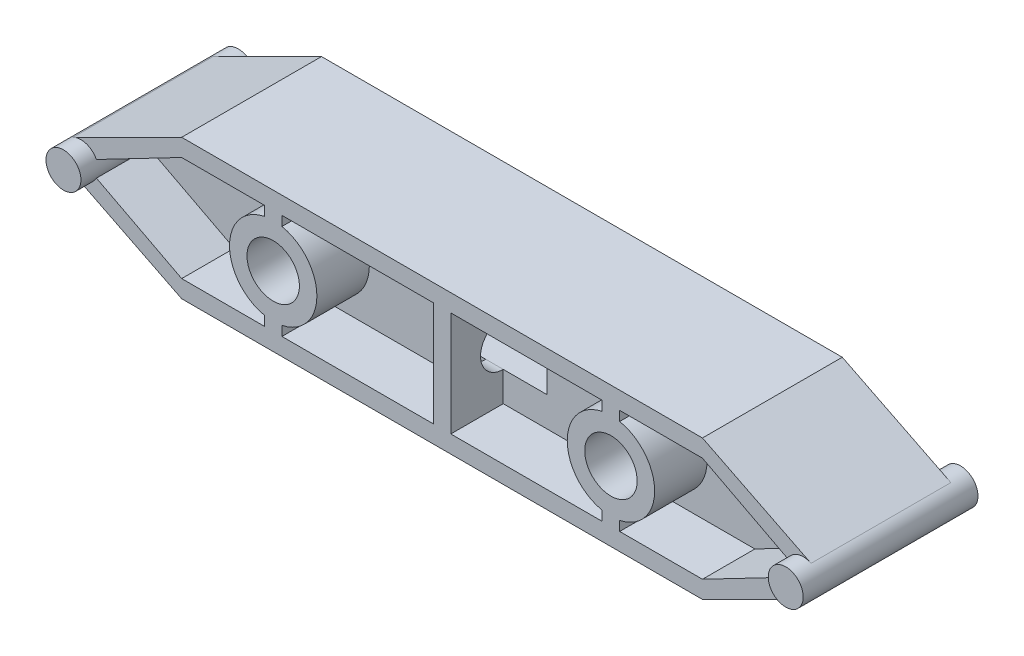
ISO-10303-21;
HEADER;
FILE_DESCRIPTION(('STEP AP214'),'2;1');
FILE_NAME('part.step','',(''),(''),'','','');
FILE_SCHEMA(('AUTOMOTIVE_DESIGN { 1 0 10303 214 1 1 1 1 }'));
ENDSEC;
DATA;
#1=APPLICATION_CONTEXT('core data for automotive mechanical design processes');
#2=APPLICATION_PROTOCOL_DEFINITION('international standard','automotive_design',2000,#1);
#3=PRODUCT_CONTEXT('',#1,'mechanical');
#4=PRODUCT('Part','Part','',(#3));
#5=PRODUCT_RELATED_PRODUCT_CATEGORY('part','',(#4));
#6=PRODUCT_DEFINITION_FORMATION('','',#4);
#7=PRODUCT_DEFINITION_CONTEXT('part definition',#1,'design');
#8=PRODUCT_DEFINITION('design','',#6,#7);
#9=PRODUCT_DEFINITION_SHAPE('','',#8);
#10=(LENGTH_UNIT() NAMED_UNIT(*) SI_UNIT(.MILLI.,.METRE.));
#11=(NAMED_UNIT(*) PLANE_ANGLE_UNIT() SI_UNIT($,.RADIAN.));
#12=(NAMED_UNIT(*) SI_UNIT($,.STERADIAN.) SOLID_ANGLE_UNIT());
#13=UNCERTAINTY_MEASURE_WITH_UNIT(LENGTH_MEASURE(1.E-05),#10,'distance_accuracy_value','');
#14=(GEOMETRIC_REPRESENTATION_CONTEXT(3) GLOBAL_UNCERTAINTY_ASSIGNED_CONTEXT((#13)) GLOBAL_UNIT_ASSIGNED_CONTEXT((#10,
#11,#12)) REPRESENTATION_CONTEXT('',''));
#15=CARTESIAN_POINT('',(0.,0.,0.));
#16=DIRECTION('',(0.,0.,1.));
#17=DIRECTION('',(1.,0.,0.));
#18=AXIS2_PLACEMENT_3D('',#15,#16,#17);
#19=CARTESIAN_POINT('',(0.,0.,3.81));
#20=DIRECTION('',(0.,0.,-1.));
#21=DIRECTION('',(-1.,0.,0.));
#22=AXIS2_PLACEMENT_3D('',#19,#20,#21);
#23=PLANE('',#22);
#24=DIRECTION('',(1.,0.,0.));
#25=VECTOR('',#24,1.);
#26=CARTESIAN_POINT('',(0.,-3.81,3.81));
#27=LINE('',#26,#25);
#28=CARTESIAN_POINT('',(-32.6486294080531,-3.81,3.81));
#29=VERTEX_POINT('',#28);
#30=CARTESIAN_POINT('',(-26.6338230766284,-3.81,3.81));
#31=VERTEX_POINT('',#30);
#32=EDGE_CURVE('E724',#29,#31,#27,.T.);
#33=ORIENTED_EDGE('',*,*,#32,.F.);
#34=DIRECTION('',(0.,-1.,0.));
#35=VECTOR('',#34,1.);
#36=CARTESIAN_POINT('',(-32.6486294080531,0.,3.81));
#37=LINE('',#36,#35);
#38=CARTESIAN_POINT('',(-32.6486294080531,-3.11085197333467,3.81));
#39=VERTEX_POINT('',#38);
#40=EDGE_CURVE('E2004',#39,#29,#37,.T.);
#41=ORIENTED_EDGE('',*,*,#40,.F.);
#42=CARTESIAN_POINT('',(-33.2836294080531,0.,3.81));
#43=DIRECTION('',(0.,0.,-1.));
#44=DIRECTION('',(-1.,0.,0.));
#45=AXIS2_PLACEMENT_3D('',#42,#43,#44);
#46=CIRCLE('',#45,3.17500000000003);
#47=CARTESIAN_POINT('',(-32.6486294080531,3.11085197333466,3.81));
#48=VERTEX_POINT('',#47);
#49=EDGE_CURVE('E482',#48,#39,#46,.T.);
#50=ORIENTED_EDGE('',*,*,#49,.F.);
#51=DIRECTION('',(0.,-1.,0.));
#52=VECTOR('',#51,1.);
#53=CARTESIAN_POINT('',(-32.6486294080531,0.,3.81));
#54=LINE('',#53,#52);
#55=CARTESIAN_POINT('',(-32.6486294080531,3.81,3.81));
#56=VERTEX_POINT('',#55);
#57=EDGE_CURVE('E478',#56,#48,#54,.T.);
#58=ORIENTED_EDGE('',*,*,#57,.F.);
#59=DIRECTION('',(-1.,0.,0.));
#60=VECTOR('',#59,1.);
#61=CARTESIAN_POINT('',(0.,3.81,3.81));
#62=LINE('',#61,#60);
#63=CARTESIAN_POINT('',(-26.6338230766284,3.81,3.81));
#64=VERTEX_POINT('',#63);
#65=EDGE_CURVE('E711',#64,#56,#62,.T.);
#66=ORIENTED_EDGE('',*,*,#65,.F.);
#67=DIRECTION('',(0.914121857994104,-0.405439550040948,0.));
#68=VECTOR('',#67,1.);
#69=CARTESIAN_POINT('',(-2.96603396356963,-6.68735074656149,3.81));
#70=LINE('',#69,#68);
#71=CARTESIAN_POINT('',(-20.166101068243,0.941377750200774,3.81));
#72=VERTEX_POINT('',#71);
#73=EDGE_CURVE('E714',#64,#72,#70,.T.);
#74=ORIENTED_EDGE('',*,*,#73,.T.);
#75=CARTESIAN_POINT('',(-19.3136294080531,0.,3.81));
#76=DIRECTION('',(0.,0.,-1.));
#77=DIRECTION('',(-1.,0.,0.));
#78=AXIS2_PLACEMENT_3D('',#75,#76,#77);
#79=CIRCLE('',#78,1.27000000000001);
#80=CARTESIAN_POINT('',(-20.166101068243,-0.941377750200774,3.81));
#81=VERTEX_POINT('',#80);
#82=EDGE_CURVE('E719',#72,#81,#79,.F.);
#83=ORIENTED_EDGE('',*,*,#82,.T.);
#84=DIRECTION('',(0.914121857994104,0.405439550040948,0.));
#85=VECTOR('',#84,1.);
#86=CARTESIAN_POINT('',(-2.96603396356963,6.68735074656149,3.81));
#87=LINE('',#86,#85);
#88=EDGE_CURVE('E722',#31,#81,#87,.T.);
#89=ORIENTED_EDGE('',*,*,#88,.F.);
#90=EDGE_LOOP('',(#33,#41,#50,#58,#66,#74,#83,#89));
#91=FACE_BOUND('',#90,.T.);
#92=ADVANCED_FACE('F44',(#91),#23,.T.);
#93=CARTESIAN_POINT('',(0.,3.81,3.81));
#94=DIRECTION('',(0.,-1.,0.));
#95=DIRECTION('',(0.,0.,-1.));
#96=AXIS2_PLACEMENT_3D('',#93,#94,#95);
#97=PLANE('',#96);
#98=ORIENTED_EDGE('',*,*,#65,.T.);
#99=DIRECTION('',(0.,0.,1.));
#100=VECTOR('',#99,1.);
#101=CARTESIAN_POINT('',(-32.6486294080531,3.81,0.));
#102=LINE('',#101,#100);
#103=CARTESIAN_POINT('',(-32.6486294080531,3.81,0.));
#104=VERTEX_POINT('',#103);
#105=EDGE_CURVE('E1998',#104,#56,#102,.T.);
#106=ORIENTED_EDGE('',*,*,#105,.F.);
#107=DIRECTION('',(-1.,0.,0.));
#108=VECTOR('',#107,1.);
#109=CARTESIAN_POINT('',(0.,3.81,0.));
#110=LINE('',#109,#108);
#111=CARTESIAN_POINT('',(-26.6338230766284,3.81,0.));
#112=VERTEX_POINT('',#111);
#113=EDGE_CURVE('E738',#112,#104,#110,.T.);
#114=ORIENTED_EDGE('',*,*,#113,.F.);
#115=DIRECTION('',(0.,0.,-1.));
#116=VECTOR('',#115,1.);
#117=CARTESIAN_POINT('',(-26.6338230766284,3.81,3.81));
#118=LINE('',#117,#116);
#119=EDGE_CURVE('E737',#64,#112,#118,.T.);
#120=ORIENTED_EDGE('',*,*,#119,.F.);
#121=EDGE_LOOP('',(#98,#106,#114,#120));
#122=FACE_BOUND('',#121,.T.);
#123=ADVANCED_FACE('F1078',(#122),#97,.T.);
#124=CARTESIAN_POINT('',(0.,-3.81,3.81));
#125=DIRECTION('',(0.,1.,0.));
#126=DIRECTION('',(0.,0.,1.));
#127=AXIS2_PLACEMENT_3D('',#124,#125,#126);
#128=PLANE('',#127);
#129=DIRECTION('',(1.,0.,0.));
#130=VECTOR('',#129,1.);
#131=CARTESIAN_POINT('',(0.,-3.81,0.));
#132=LINE('',#131,#130);
#133=CARTESIAN_POINT('',(-32.6486294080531,-3.81,0.));
#134=VERTEX_POINT('',#133);
#135=CARTESIAN_POINT('',(-26.6338230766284,-3.81,0.));
#136=VERTEX_POINT('',#135);
#137=EDGE_CURVE('E747',#134,#136,#132,.T.);
#138=ORIENTED_EDGE('',*,*,#137,.F.);
#139=DIRECTION('',(0.,0.,1.));
#140=VECTOR('',#139,1.);
#141=CARTESIAN_POINT('',(-32.6486294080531,-3.81,0.));
#142=LINE('',#141,#140);
#143=EDGE_CURVE('E463',#134,#29,#142,.T.);
#144=ORIENTED_EDGE('',*,*,#143,.T.);
#145=ORIENTED_EDGE('',*,*,#32,.T.);
#146=DIRECTION('',(0.,0.,-1.));
#147=VECTOR('',#146,1.);
#148=CARTESIAN_POINT('',(-26.6338230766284,-3.81,3.81));
#149=LINE('',#148,#147);
#150=EDGE_CURVE('E768',#31,#136,#149,.T.);
#151=ORIENTED_EDGE('',*,*,#150,.T.);
#152=EDGE_LOOP('',(#138,#144,#145,#151));
#153=FACE_BOUND('',#152,.T.);
#154=ADVANCED_FACE('F1083',(#153),#128,.T.);
#155=DIRECTION('',(-1.,0.,0.));
#156=VECTOR('',#155,1.);
#157=CARTESIAN_POINT('',(0.,1.651,3.81));
#158=LINE('',#157,#156);
#159=CARTESIAN_POINT('',(-41.7435015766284,1.651,3.81));
#160=VERTEX_POINT('',#159);
#161=CARTESIAN_POINT('',(-49.3635015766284,1.651,3.81));
#162=VERTEX_POINT('',#161);
#163=EDGE_CURVE('E12',#160,#162,#158,.T.);
#164=ORIENTED_EDGE('',*,*,#163,.T.);
#165=DIRECTION('',(0.,1.,0.));
#166=VECTOR('',#165,1.);
#167=CARTESIAN_POINT('',(-49.3635015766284,0.,3.81));
#168=LINE('',#167,#166);
#169=CARTESIAN_POINT('',(-49.3635015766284,-1.651,3.81));
#170=VERTEX_POINT('',#169);
#171=EDGE_CURVE('E849',#170,#162,#168,.T.);
#172=ORIENTED_EDGE('',*,*,#171,.F.);
#173=DIRECTION('',(-1.,0.,0.));
#174=VECTOR('',#173,1.);
#175=CARTESIAN_POINT('',(0.,-1.65099999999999,3.81));
#176=LINE('',#175,#174);
#177=CARTESIAN_POINT('',(-41.7435015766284,-1.651,3.81));
#178=VERTEX_POINT('',#177);
#179=EDGE_CURVE('E851',#178,#170,#176,.T.);
#180=ORIENTED_EDGE('',*,*,#179,.F.);
#181=DIRECTION('',(0.,1.,0.));
#182=VECTOR('',#181,1.);
#183=CARTESIAN_POINT('',(-41.7435015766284,0.,3.81));
#184=LINE('',#183,#182);
#185=EDGE_CURVE('E52',#178,#160,#184,.T.);
#186=ORIENTED_EDGE('',*,*,#185,.T.);
#187=EDGE_LOOP('',(#164,#172,#180,#186));
#188=FACE_BOUND('',#187,.T.);
#189=DIRECTION('',(0.,-1.,0.));
#190=VECTOR('',#189,1.);
#191=CARTESIAN_POINT('',(-33.9186294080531,0.,3.81));
#192=LINE('',#191,#190);
#193=CARTESIAN_POINT('',(-33.9186294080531,-3.11085197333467,3.81));
#194=VERTEX_POINT('',#193);
#195=CARTESIAN_POINT('',(-33.9186294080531,-3.81,3.81));
#196=VERTEX_POINT('',#195);
#197=EDGE_CURVE('E2006',#194,#196,#192,.T.);
#198=ORIENTED_EDGE('',*,*,#197,.T.);
#199=CARTESIAN_POINT('',(-57.1883737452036,-3.81,3.81));
#200=VERTEX_POINT('',#199);
#201=EDGE_CURVE('E729',#200,#196,#27,.T.);
#202=ORIENTED_EDGE('',*,*,#201,.F.);
#203=DIRECTION('',(0.,-1.,0.));
#204=VECTOR('',#203,1.);
#205=CARTESIAN_POINT('',(-57.1883737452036,0.,3.81));
#206=LINE('',#205,#204);
#207=CARTESIAN_POINT('',(-57.1883737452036,-3.11085197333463,3.81));
#208=VERTEX_POINT('',#207);
#209=EDGE_CURVE('E487',#208,#200,#206,.T.);
#210=ORIENTED_EDGE('',*,*,#209,.F.);
#211=CARTESIAN_POINT('',(-57.8233737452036,0.,3.81));
#212=DIRECTION('',(0.,0.,-1.));
#213=DIRECTION('',(-1.,0.,0.));
#214=AXIS2_PLACEMENT_3D('',#211,#212,#213);
#215=CIRCLE('',#214,3.175);
#216=CARTESIAN_POINT('',(-57.1883737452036,3.11085197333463,3.81));
#217=VERTEX_POINT('',#216);
#218=EDGE_CURVE('E484',#217,#208,#215,.T.);
#219=ORIENTED_EDGE('',*,*,#218,.F.);
#220=DIRECTION('',(0.,-1.,0.));
#221=VECTOR('',#220,1.);
#222=CARTESIAN_POINT('',(-57.1883737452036,0.,3.81));
#223=LINE('',#222,#221);
#224=CARTESIAN_POINT('',(-57.1883737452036,3.81,3.81));
#225=VERTEX_POINT('',#224);
#226=EDGE_CURVE('E497',#225,#217,#223,.T.);
#227=ORIENTED_EDGE('',*,*,#226,.F.);
#228=CARTESIAN_POINT('',(-33.9186294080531,3.81,3.81));
#229=VERTEX_POINT('',#228);
#230=EDGE_CURVE('E715',#229,#225,#62,.T.);
#231=ORIENTED_EDGE('',*,*,#230,.F.);
#232=DIRECTION('',(0.,-1.,0.));
#233=VECTOR('',#232,1.);
#234=CARTESIAN_POINT('',(-33.9186294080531,0.,3.81));
#235=LINE('',#234,#233);
#236=CARTESIAN_POINT('',(-33.9186294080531,3.11085197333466,3.81));
#237=VERTEX_POINT('',#236);
#238=EDGE_CURVE('E2000',#229,#237,#235,.T.);
#239=ORIENTED_EDGE('',*,*,#238,.T.);
#240=CARTESIAN_POINT('',(-33.2836294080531,0.,3.81));
#241=DIRECTION('',(0.,0.,-1.));
#242=DIRECTION('',(-1.,0.,0.));
#243=AXIS2_PLACEMENT_3D('',#240,#241,#242);
#244=CIRCLE('',#243,3.17500000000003);
#245=EDGE_CURVE('E2013',#194,#237,#244,.T.);
#246=ORIENTED_EDGE('',*,*,#245,.F.);
#247=EDGE_LOOP('',(#198,#202,#210,#219,#227,#231,#239,#246));
#248=FACE_BOUND('',#247,.T.);
#249=ADVANCED_FACE('F856',(#188,#248),#23,.T.);
#250=DIRECTION('',(0.,0.,1.));
#251=VECTOR('',#250,1.);
#252=CARTESIAN_POINT('',(-33.9186294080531,3.81,0.));
#253=LINE('',#252,#251);
#254=CARTESIAN_POINT('',(-33.9186294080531,3.81,0.));
#255=VERTEX_POINT('',#254);
#256=EDGE_CURVE('E1155',#255,#229,#253,.T.);
#257=ORIENTED_EDGE('',*,*,#256,.T.);
#258=ORIENTED_EDGE('',*,*,#230,.T.);
#259=DIRECTION('',(0.,0.,1.));
#260=VECTOR('',#259,1.);
#261=CARTESIAN_POINT('',(-57.1883737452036,3.81,0.));
#262=LINE('',#261,#260);
#263=CARTESIAN_POINT('',(-57.1883737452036,3.81,0.));
#264=VERTEX_POINT('',#263);
#265=EDGE_CURVE('E525',#264,#225,#262,.T.);
#266=ORIENTED_EDGE('',*,*,#265,.F.);
#267=EDGE_CURVE('E741',#255,#264,#110,.T.);
#268=ORIENTED_EDGE('',*,*,#267,.F.);
#269=EDGE_LOOP('',(#257,#258,#266,#268));
#270=FACE_BOUND('',#269,.T.);
#271=ADVANCED_FACE('F1086',(#270),#97,.T.);
#272=DIRECTION('',(0.,0.,1.));
#273=VECTOR('',#272,1.);
#274=CARTESIAN_POINT('',(-33.9186294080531,-3.81,0.));
#275=LINE('',#274,#273);
#276=CARTESIAN_POINT('',(-33.9186294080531,-3.81,0.));
#277=VERTEX_POINT('',#276);
#278=EDGE_CURVE('E489',#277,#196,#275,.T.);
#279=ORIENTED_EDGE('',*,*,#278,.F.);
#280=CARTESIAN_POINT('',(-57.1883737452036,-3.81,0.));
#281=VERTEX_POINT('',#280);
#282=EDGE_CURVE('E752',#281,#277,#132,.T.);
#283=ORIENTED_EDGE('',*,*,#282,.F.);
#284=DIRECTION('',(0.,0.,1.));
#285=VECTOR('',#284,1.);
#286=CARTESIAN_POINT('',(-57.1883737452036,-3.81,0.));
#287=LINE('',#286,#285);
#288=EDGE_CURVE('E67',#281,#200,#287,.T.);
#289=ORIENTED_EDGE('',*,*,#288,.T.);
#290=ORIENTED_EDGE('',*,*,#201,.T.);
#291=EDGE_LOOP('',(#279,#283,#289,#290));
#292=FACE_BOUND('',#291,.T.);
#293=ADVANCED_FACE('F1096',(#292),#128,.T.);
#294=CARTESIAN_POINT('',(0.,0.,6.35));
#295=DIRECTION('',(0.,0.,1.));
#296=DIRECTION('',(1.,0.,0.));
#297=AXIS2_PLACEMENT_3D('',#294,#295,#296);
#298=PLANE('',#297);
#299=DIRECTION('',(0.,-1.,0.));
#300=VECTOR('',#299,1.);
#301=CARTESIAN_POINT('',(-49.3635015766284,0.,6.35));
#302=LINE('',#301,#300);
#303=CARTESIAN_POINT('',(-49.3635015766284,1.651,6.35));
#304=VERTEX_POINT('',#303);
#305=CARTESIAN_POINT('',(-49.3635015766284,-1.651,6.35));
#306=VERTEX_POINT('',#305);
#307=EDGE_CURVE('E706',#304,#306,#302,.T.);
#308=ORIENTED_EDGE('',*,*,#307,.F.);
#309=DIRECTION('',(1.,0.,0.));
#310=VECTOR('',#309,1.);
#311=CARTESIAN_POINT('',(0.,1.651,6.35));
#312=LINE('',#311,#310);
#313=CARTESIAN_POINT('',(-46.1885015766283,1.65100000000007,6.35));
#314=VERTEX_POINT('',#313);
#315=EDGE_CURVE('E697',#304,#314,#312,.T.);
#316=ORIENTED_EDGE('',*,*,#315,.T.);
#317=DIRECTION('',(0.,-1.,0.));
#318=VECTOR('',#317,1.);
#319=CARTESIAN_POINT('',(-46.1885015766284,0.,6.35));
#320=LINE('',#319,#318);
#321=CARTESIAN_POINT('',(-46.1885015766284,3.81,6.35));
#322=VERTEX_POINT('',#321);
#323=EDGE_CURVE('E548',#322,#314,#320,.T.);
#324=ORIENTED_EDGE('',*,*,#323,.F.);
#325=DIRECTION('',(-1.,0.,0.));
#326=VECTOR('',#325,1.);
#327=CARTESIAN_POINT('',(0.,3.81,6.35));
#328=LINE('',#327,#326);
#329=CARTESIAN_POINT('',(-57.1883737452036,3.81,6.35));
#330=VERTEX_POINT('',#329);
#331=EDGE_CURVE('E919',#322,#330,#328,.T.);
#332=ORIENTED_EDGE('',*,*,#331,.T.);
#333=DIRECTION('',(0.,-1.,0.));
#334=VECTOR('',#333,1.);
#335=CARTESIAN_POINT('',(-57.1883737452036,0.,6.35));
#336=LINE('',#335,#334);
#337=CARTESIAN_POINT('',(-57.1883737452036,3.11085197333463,6.35));
#338=VERTEX_POINT('',#337);
#339=EDGE_CURVE('E601',#330,#338,#336,.T.);
#340=ORIENTED_EDGE('',*,*,#339,.T.);
#341=CARTESIAN_POINT('',(-57.8233737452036,0.,6.35));
#342=DIRECTION('',(0.,0.,1.));
#343=DIRECTION('',(1.,0.,0.));
#344=AXIS2_PLACEMENT_3D('',#341,#342,#343);
#345=CIRCLE('',#344,3.175);
#346=CARTESIAN_POINT('',(-57.1883737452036,-3.11085197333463,6.35));
#347=VERTEX_POINT('',#346);
#348=EDGE_CURVE('E598',#347,#338,#345,.T.);
#349=ORIENTED_EDGE('',*,*,#348,.F.);
#350=DIRECTION('',(0.,-1.,0.));
#351=VECTOR('',#350,1.);
#352=CARTESIAN_POINT('',(-57.1883737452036,0.,6.35));
#353=LINE('',#352,#351);
#354=CARTESIAN_POINT('',(-57.1883737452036,-3.81,6.35));
#355=VERTEX_POINT('',#354);
#356=EDGE_CURVE('E596',#347,#355,#353,.T.);
#357=ORIENTED_EDGE('',*,*,#356,.T.);
#358=DIRECTION('',(1.,0.,0.));
#359=VECTOR('',#358,1.);
#360=CARTESIAN_POINT('',(0.,-3.81,6.35));
#361=LINE('',#360,#359);
#362=CARTESIAN_POINT('',(-46.1885015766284,-3.81,6.35));
#363=VERTEX_POINT('',#362);
#364=EDGE_CURVE('E891',#355,#363,#361,.T.);
#365=ORIENTED_EDGE('',*,*,#364,.T.);
#366=CARTESIAN_POINT('',(-46.1885015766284,-1.651,6.35));
#367=VERTEX_POINT('',#366);
#368=EDGE_CURVE('E554',#367,#363,#320,.T.);
#369=ORIENTED_EDGE('',*,*,#368,.F.);
#370=DIRECTION('',(1.,0.,0.));
#371=VECTOR('',#370,1.);
#372=CARTESIAN_POINT('',(0.,-1.65099999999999,6.35));
#373=LINE('',#372,#371);
#374=EDGE_CURVE('E703',#306,#367,#373,.T.);
#375=ORIENTED_EDGE('',*,*,#374,.F.);
#376=EDGE_LOOP('',(#308,#316,#324,#332,#340,#349,#357,#365,#369,#375));
#377=FACE_BOUND('',#376,.T.);
#378=ADVANCED_FACE('F889',(#377),#298,.T.);
#379=CARTESIAN_POINT('',(0.,-3.81,6.35));
#380=DIRECTION('',(0.,-1.,0.));
#381=DIRECTION('',(0.,0.,-1.));
#382=AXIS2_PLACEMENT_3D('',#379,#380,#381);
#383=PLANE('',#382);
#384=DIRECTION('',(0.,0.,-1.));
#385=VECTOR('',#384,1.);
#386=CARTESIAN_POINT('',(-46.1885015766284,-3.81,10.16));
#387=LINE('',#386,#385);
#388=CARTESIAN_POINT('',(-46.1885015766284,-3.81,10.16));
#389=VERTEX_POINT('',#388);
#390=EDGE_CURVE('E558',#389,#363,#387,.T.);
#391=ORIENTED_EDGE('',*,*,#390,.T.);
#392=ORIENTED_EDGE('',*,*,#364,.F.);
#393=DIRECTION('',(0.,0.,-1.));
#394=VECTOR('',#393,1.);
#395=CARTESIAN_POINT('',(-57.1883737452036,-3.81,10.16));
#396=LINE('',#395,#394);
#397=CARTESIAN_POINT('',(-57.1883737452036,-3.81,10.16));
#398=VERTEX_POINT('',#397);
#399=EDGE_CURVE('E619',#398,#355,#396,.T.);
#400=ORIENTED_EDGE('',*,*,#399,.F.);
#401=DIRECTION('',(1.,0.,0.));
#402=VECTOR('',#401,1.);
#403=CARTESIAN_POINT('',(0.,-3.81,10.16));
#404=LINE('',#403,#402);
#405=EDGE_CURVE('E935',#398,#389,#404,.T.);
#406=ORIENTED_EDGE('',*,*,#405,.T.);
#407=EDGE_LOOP('',(#391,#392,#400,#406));
#408=FACE_BOUND('',#407,.T.);
#409=ADVANCED_FACE('F1270',(#408),#383,.F.);
#410=CARTESIAN_POINT('',(0.,3.81,6.35));
#411=DIRECTION('',(0.,1.,0.));
#412=DIRECTION('',(0.,0.,1.));
#413=AXIS2_PLACEMENT_3D('',#410,#411,#412);
#414=PLANE('',#413);
#415=DIRECTION('',(0.,0.,-1.));
#416=VECTOR('',#415,1.);
#417=CARTESIAN_POINT('',(-46.1885015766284,3.81,10.16));
#418=LINE('',#417,#416);
#419=CARTESIAN_POINT('',(-46.1885015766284,3.81,10.16));
#420=VERTEX_POINT('',#419);
#421=EDGE_CURVE('E561',#420,#322,#418,.T.);
#422=ORIENTED_EDGE('',*,*,#421,.F.);
#423=DIRECTION('',(-1.,0.,0.));
#424=VECTOR('',#423,1.);
#425=CARTESIAN_POINT('',(0.,3.81,10.16));
#426=LINE('',#425,#424);
#427=CARTESIAN_POINT('',(-57.1883737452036,3.81,10.16));
#428=VERTEX_POINT('',#427);
#429=EDGE_CURVE('E1053',#420,#428,#426,.T.);
#430=ORIENTED_EDGE('',*,*,#429,.T.);
#431=DIRECTION('',(0.,0.,-1.));
#432=VECTOR('',#431,1.);
#433=CARTESIAN_POINT('',(-57.1883737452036,3.81,10.16));
#434=LINE('',#433,#432);
#435=EDGE_CURVE('E610',#428,#330,#434,.T.);
#436=ORIENTED_EDGE('',*,*,#435,.T.);
#437=ORIENTED_EDGE('',*,*,#331,.F.);
#438=EDGE_LOOP('',(#422,#430,#436,#437));
#439=FACE_BOUND('',#438,.T.);
#440=ADVANCED_FACE('F1275',(#439),#414,.F.);
#441=CARTESIAN_POINT('',(-64.4731800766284,-3.81,6.35));
#442=VERTEX_POINT('',#441);
#443=CARTESIAN_POINT('',(-58.4583737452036,-3.81,6.35));
#444=VERTEX_POINT('',#443);
#445=EDGE_CURVE('E894',#442,#444,#361,.T.);
#446=ORIENTED_EDGE('',*,*,#445,.T.);
#447=DIRECTION('',(0.,-1.,0.));
#448=VECTOR('',#447,1.);
#449=CARTESIAN_POINT('',(-58.4583737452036,0.,6.35));
#450=LINE('',#449,#448);
#451=CARTESIAN_POINT('',(-58.4583737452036,-3.11085197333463,6.35));
#452=VERTEX_POINT('',#451);
#453=EDGE_CURVE('E593',#452,#444,#450,.T.);
#454=ORIENTED_EDGE('',*,*,#453,.F.);
#455=CARTESIAN_POINT('',(-57.8233737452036,0.,6.35));
#456=DIRECTION('',(0.,0.,1.));
#457=DIRECTION('',(1.,0.,0.));
#458=AXIS2_PLACEMENT_3D('',#455,#456,#457);
#459=CIRCLE('',#458,3.175);
#460=CARTESIAN_POINT('',(-58.4583737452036,3.11085197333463,6.35));
#461=VERTEX_POINT('',#460);
#462=EDGE_CURVE('E569',#461,#452,#459,.T.);
#463=ORIENTED_EDGE('',*,*,#462,.F.);
#464=DIRECTION('',(0.,-1.,0.));
#465=VECTOR('',#464,1.);
#466=CARTESIAN_POINT('',(-58.4583737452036,0.,6.35));
#467=LINE('',#466,#465);
#468=CARTESIAN_POINT('',(-58.4583737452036,3.81,6.35));
#469=VERTEX_POINT('',#468);
#470=EDGE_CURVE('E574',#469,#461,#467,.T.);
#471=ORIENTED_EDGE('',*,*,#470,.F.);
#472=CARTESIAN_POINT('',(-64.4731800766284,3.81,6.35));
#473=VERTEX_POINT('',#472);
#474=EDGE_CURVE('E921',#469,#473,#328,.T.);
#475=ORIENTED_EDGE('',*,*,#474,.T.);
#476=DIRECTION('',(-0.887043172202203,-0.461686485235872,0.));
#477=VECTOR('',#476,1.);
#478=CARTESIAN_POINT('',(-15.3030742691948,29.4019599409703,6.35));
#479=LINE('',#478,#477);
#480=CARTESIAN_POINT('',(-70.6668289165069,0.58634183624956,6.35));
#481=VERTEX_POINT('',#480);
#482=EDGE_CURVE('E911',#473,#481,#479,.T.);
#483=ORIENTED_EDGE('',*,*,#482,.T.);
#484=CARTESIAN_POINT('',(-71.7933737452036,0.,6.35));
#485=DIRECTION('',(0.,0.,1.));
#486=DIRECTION('',(1.,0.,0.));
#487=AXIS2_PLACEMENT_3D('',#484,#485,#486);
#488=CIRCLE('',#487,1.26999999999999);
#489=CARTESIAN_POINT('',(-70.6668289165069,-0.586341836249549,6.35));
#490=VERTEX_POINT('',#489);
#491=EDGE_CURVE('E907',#490,#481,#488,.T.);
#492=ORIENTED_EDGE('',*,*,#491,.F.);
#493=DIRECTION('',(-0.887043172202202,0.461686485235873,0.));
#494=VECTOR('',#493,1.);
#495=CARTESIAN_POINT('',(-15.3030742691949,-29.4019599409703,6.35));
#496=LINE('',#495,#494);
#497=EDGE_CURVE('E902',#442,#490,#496,.T.);
#498=ORIENTED_EDGE('',*,*,#497,.F.);
#499=EDGE_LOOP('',(#446,#454,#463,#471,#475,#483,#492,#498));
#500=FACE_BOUND('',#499,.T.);
#501=ADVANCED_FACE('F1044',(#500),#298,.T.);
#502=DIRECTION('',(0.,0.,-1.));
#503=VECTOR('',#502,1.);
#504=CARTESIAN_POINT('',(-58.4583737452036,-3.81,10.16));
#505=LINE('',#504,#503);
#506=CARTESIAN_POINT('',(-58.4583737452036,-3.81,10.16));
#507=VERTEX_POINT('',#506);
#508=EDGE_CURVE('E622',#507,#444,#505,.T.);
#509=ORIENTED_EDGE('',*,*,#508,.T.);
#510=ORIENTED_EDGE('',*,*,#445,.F.);
#511=DIRECTION('',(0.,0.,1.));
#512=VECTOR('',#511,1.);
#513=CARTESIAN_POINT('',(-64.4731800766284,-3.81,6.35));
#514=LINE('',#513,#512);
#515=CARTESIAN_POINT('',(-64.4731800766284,-3.81,10.16));
#516=VERTEX_POINT('',#515);
#517=EDGE_CURVE('E825',#442,#516,#514,.T.);
#518=ORIENTED_EDGE('',*,*,#517,.T.);
#519=EDGE_CURVE('E930',#516,#507,#404,.T.);
#520=ORIENTED_EDGE('',*,*,#519,.T.);
#521=EDGE_LOOP('',(#509,#510,#518,#520));
#522=FACE_BOUND('',#521,.T.);
#523=ADVANCED_FACE('F1277',(#522),#383,.F.);
#524=DIRECTION('',(0.,0.,-1.));
#525=VECTOR('',#524,1.);
#526=CARTESIAN_POINT('',(-58.4583737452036,3.81,10.16));
#527=LINE('',#526,#525);
#528=CARTESIAN_POINT('',(-58.4583737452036,3.81,10.16));
#529=VERTEX_POINT('',#528);
#530=EDGE_CURVE('E607',#529,#469,#527,.T.);
#531=ORIENTED_EDGE('',*,*,#530,.F.);
#532=CARTESIAN_POINT('',(-64.4731800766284,3.81,10.16));
#533=VERTEX_POINT('',#532);
#534=EDGE_CURVE('E1050',#529,#533,#426,.T.);
#535=ORIENTED_EDGE('',*,*,#534,.T.);
#536=DIRECTION('',(0.,0.,1.));
#537=VECTOR('',#536,1.);
#538=CARTESIAN_POINT('',(-64.4731800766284,3.81,6.35));
#539=LINE('',#538,#537);
#540=EDGE_CURVE('E946',#473,#533,#539,.T.);
#541=ORIENTED_EDGE('',*,*,#540,.F.);
#542=ORIENTED_EDGE('',*,*,#474,.F.);
#543=EDGE_LOOP('',(#531,#535,#541,#542));
#544=FACE_BOUND('',#543,.T.);
#545=ADVANCED_FACE('F1049',(#544),#414,.F.);
#546=DIRECTION('',(0.,-1.,0.));
#547=VECTOR('',#546,1.);
#548=CARTESIAN_POINT('',(-41.7435015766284,0.,6.35));
#549=LINE('',#548,#547);
#550=CARTESIAN_POINT('',(-41.7435015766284,1.651,6.35));
#551=VERTEX_POINT('',#550);
#552=CARTESIAN_POINT('',(-41.7435015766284,-1.651,6.35));
#553=VERTEX_POINT('',#552);
#554=EDGE_CURVE('E700',#551,#553,#549,.T.);
#555=ORIENTED_EDGE('',*,*,#554,.T.);
#556=CARTESIAN_POINT('',(-44.9185015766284,-1.65099999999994,6.35));
#557=VERTEX_POINT('',#556);
#558=EDGE_CURVE('E702',#557,#553,#373,.T.);
#559=ORIENTED_EDGE('',*,*,#558,.F.);
#560=DIRECTION('',(0.,-1.,0.));
#561=VECTOR('',#560,1.);
#562=CARTESIAN_POINT('',(-44.9185015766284,0.,6.35));
#563=LINE('',#562,#561);
#564=CARTESIAN_POINT('',(-44.9185015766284,-3.81,6.35));
#565=VERTEX_POINT('',#564);
#566=EDGE_CURVE('E544',#557,#565,#563,.T.);
#567=ORIENTED_EDGE('',*,*,#566,.T.);
#568=CARTESIAN_POINT('',(-33.9186294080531,-3.81,6.35));
#569=VERTEX_POINT('',#568);
#570=EDGE_CURVE('E895',#565,#569,#361,.T.);
#571=ORIENTED_EDGE('',*,*,#570,.T.);
#572=DIRECTION('',(0.,-1.,0.));
#573=VECTOR('',#572,1.);
#574=CARTESIAN_POINT('',(-33.9186294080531,0.,6.35));
#575=LINE('',#574,#573);
#576=CARTESIAN_POINT('',(-33.9186294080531,-3.11085197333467,6.35));
#577=VERTEX_POINT('',#576);
#578=EDGE_CURVE('E651',#577,#569,#575,.T.);
#579=ORIENTED_EDGE('',*,*,#578,.F.);
#580=CARTESIAN_POINT('',(-33.2836294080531,0.,6.35));
#581=DIRECTION('',(0.,0.,1.));
#582=DIRECTION('',(1.,0.,0.));
#583=AXIS2_PLACEMENT_3D('',#580,#581,#582);
#584=CIRCLE('',#583,3.17500000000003);
#585=CARTESIAN_POINT('',(-33.9186294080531,3.11085197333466,6.35));
#586=VERTEX_POINT('',#585);
#587=EDGE_CURVE('E627',#586,#577,#584,.T.);
#588=ORIENTED_EDGE('',*,*,#587,.F.);
#589=DIRECTION('',(0.,-1.,0.));
#590=VECTOR('',#589,1.);
#591=CARTESIAN_POINT('',(-33.9186294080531,0.,6.35));
#592=LINE('',#591,#590);
#593=CARTESIAN_POINT('',(-33.9186294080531,3.81,6.35));
#594=VERTEX_POINT('',#593);
#595=EDGE_CURVE('E632',#594,#586,#592,.T.);
#596=ORIENTED_EDGE('',*,*,#595,.F.);
#597=CARTESIAN_POINT('',(-44.9185015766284,3.81,6.35));
#598=VERTEX_POINT('',#597);
#599=EDGE_CURVE('E918',#594,#598,#328,.T.);
#600=ORIENTED_EDGE('',*,*,#599,.T.);
#601=CARTESIAN_POINT('',(-44.9185015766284,1.65100000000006,6.35));
#602=VERTEX_POINT('',#601);
#603=EDGE_CURVE('E551',#598,#602,#563,.T.);
#604=ORIENTED_EDGE('',*,*,#603,.T.);
#605=EDGE_CURVE('E688',#602,#551,#312,.T.);
#606=ORIENTED_EDGE('',*,*,#605,.T.);
#607=EDGE_LOOP('',(#555,#559,#567,#571,#579,#588,#596,#600,#604,#606));
#608=FACE_BOUND('',#607,.T.);
#609=ADVANCED_FACE('F872',(#608),#298,.T.);
#610=ORIENTED_EDGE('',*,*,#570,.F.);
#611=DIRECTION('',(0.,0.,-1.));
#612=VECTOR('',#611,1.);
#613=CARTESIAN_POINT('',(-44.9185015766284,-3.81,10.16));
#614=LINE('',#613,#612);
#615=CARTESIAN_POINT('',(-44.9185015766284,-3.81,10.16));
#616=VERTEX_POINT('',#615);
#617=EDGE_CURVE('E550',#616,#565,#614,.T.);
#618=ORIENTED_EDGE('',*,*,#617,.F.);
#619=CARTESIAN_POINT('',(-33.9186294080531,-3.81,10.16));
#620=VERTEX_POINT('',#619);
#621=EDGE_CURVE('E937',#616,#620,#404,.T.);
#622=ORIENTED_EDGE('',*,*,#621,.T.);
#623=DIRECTION('',(0.,0.,-1.));
#624=VECTOR('',#623,1.);
#625=CARTESIAN_POINT('',(-33.9186294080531,-3.81,10.16));
#626=LINE('',#625,#624);
#627=EDGE_CURVE('E679',#620,#569,#626,.T.);
#628=ORIENTED_EDGE('',*,*,#627,.T.);
#629=EDGE_LOOP('',(#610,#618,#622,#628));
#630=FACE_BOUND('',#629,.T.);
#631=ADVANCED_FACE('F1306',(#630),#383,.F.);
#632=CARTESIAN_POINT('',(-33.9186294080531,3.81,10.16));
#633=VERTEX_POINT('',#632);
#634=CARTESIAN_POINT('',(-44.9185015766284,3.81,10.16));
#635=VERTEX_POINT('',#634);
#636=EDGE_CURVE('E1052',#633,#635,#426,.T.);
#637=ORIENTED_EDGE('',*,*,#636,.T.);
#638=DIRECTION('',(0.,0.,-1.));
#639=VECTOR('',#638,1.);
#640=CARTESIAN_POINT('',(-44.9185015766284,3.81,10.16));
#641=LINE('',#640,#639);
#642=EDGE_CURVE('E564',#635,#598,#641,.T.);
#643=ORIENTED_EDGE('',*,*,#642,.T.);
#644=ORIENTED_EDGE('',*,*,#599,.F.);
#645=DIRECTION('',(0.,0.,-1.));
#646=VECTOR('',#645,1.);
#647=CARTESIAN_POINT('',(-33.9186294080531,3.81,10.16));
#648=LINE('',#647,#646);
#649=EDGE_CURVE('E665',#633,#594,#648,.T.);
#650=ORIENTED_EDGE('',*,*,#649,.F.);
#651=EDGE_LOOP('',(#637,#643,#644,#650));
#652=FACE_BOUND('',#651,.T.);
#653=ADVANCED_FACE('F1314',(#652),#414,.F.);
#654=DIRECTION('',(0.,-1.,0.));
#655=VECTOR('',#654,1.);
#656=CARTESIAN_POINT('',(-32.6486294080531,0.,6.35));
#657=LINE('',#656,#655);
#658=CARTESIAN_POINT('',(-32.6486294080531,-3.11085197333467,6.35));
#659=VERTEX_POINT('',#658);
#660=CARTESIAN_POINT('',(-32.6486294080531,-3.81,6.35));
#661=VERTEX_POINT('',#660);
#662=EDGE_CURVE('E654',#659,#661,#657,.T.);
#663=ORIENTED_EDGE('',*,*,#662,.T.);
#664=CARTESIAN_POINT('',(-26.6338230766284,-3.81,6.35));
#665=VERTEX_POINT('',#664);
#666=EDGE_CURVE('E897',#661,#665,#361,.T.);
#667=ORIENTED_EDGE('',*,*,#666,.T.);
#668=DIRECTION('',(0.887043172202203,0.461686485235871,0.));
#669=VECTOR('',#668,1.);
#670=CARTESIAN_POINT('',(-4.11678529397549,7.90962352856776,6.35));
#671=LINE('',#670,#669);
#672=CARTESIAN_POINT('',(-20.4401742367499,-0.586341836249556,6.35));
#673=VERTEX_POINT('',#672);
#674=EDGE_CURVE('E899',#665,#673,#671,.T.);
#675=ORIENTED_EDGE('',*,*,#674,.T.);
#676=CARTESIAN_POINT('',(-19.3136294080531,0.,6.35));
#677=DIRECTION('',(0.,0.,1.));
#678=DIRECTION('',(1.,0.,0.));
#679=AXIS2_PLACEMENT_3D('',#676,#677,#678);
#680=CIRCLE('',#679,1.27);
#681=CARTESIAN_POINT('',(-20.4401742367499,0.586341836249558,6.35));
#682=VERTEX_POINT('',#681);
#683=EDGE_CURVE('E805',#682,#673,#680,.T.);
#684=ORIENTED_EDGE('',*,*,#683,.F.);
#685=DIRECTION('',(0.887043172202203,-0.461686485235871,0.));
#686=VECTOR('',#685,1.);
#687=CARTESIAN_POINT('',(-4.11678529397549,-7.90962352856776,6.35));
#688=LINE('',#687,#686);
#689=CARTESIAN_POINT('',(-26.6338230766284,3.81,6.35));
#690=VERTEX_POINT('',#689);
#691=EDGE_CURVE('E920',#690,#682,#688,.T.);
#692=ORIENTED_EDGE('',*,*,#691,.F.);
#693=CARTESIAN_POINT('',(-32.6486294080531,3.81,6.35));
#694=VERTEX_POINT('',#693);
#695=EDGE_CURVE('E916',#690,#694,#328,.T.);
#696=ORIENTED_EDGE('',*,*,#695,.T.);
#697=DIRECTION('',(0.,-1.,0.));
#698=VECTOR('',#697,1.);
#699=CARTESIAN_POINT('',(-32.6486294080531,0.,6.35));
#700=LINE('',#699,#698);
#701=CARTESIAN_POINT('',(-32.6486294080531,3.11085197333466,6.35));
#702=VERTEX_POINT('',#701);
#703=EDGE_CURVE('E659',#694,#702,#700,.T.);
#704=ORIENTED_EDGE('',*,*,#703,.T.);
#705=CARTESIAN_POINT('',(-33.2836294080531,0.,6.35));
#706=DIRECTION('',(0.,0.,1.));
#707=DIRECTION('',(1.,0.,0.));
#708=AXIS2_PLACEMENT_3D('',#705,#706,#707);
#709=CIRCLE('',#708,3.17500000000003);
#710=EDGE_CURVE('E656',#659,#702,#709,.T.);
#711=ORIENTED_EDGE('',*,*,#710,.F.);
#712=EDGE_LOOP('',(#663,#667,#675,#684,#692,#696,#704,#711));
#713=FACE_BOUND('',#712,.T.);
#714=ADVANCED_FACE('F1061',(#713),#298,.T.);
#715=DIRECTION('',(0.,-1.,0.));
#716=VECTOR('',#715,1.);
#717=CARTESIAN_POINT('',(-58.4583737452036,0.,3.81));
#718=LINE('',#717,#716);
#719=CARTESIAN_POINT('',(-58.4583737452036,-3.11085197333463,3.81));
#720=VERTEX_POINT('',#719);
#721=CARTESIAN_POINT('',(-58.4583737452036,-3.81,3.81));
#722=VERTEX_POINT('',#721);
#723=EDGE_CURVE('E513',#720,#722,#718,.T.);
#724=ORIENTED_EDGE('',*,*,#723,.T.);
#725=CARTESIAN_POINT('',(-64.4731800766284,-3.81,3.81));
#726=VERTEX_POINT('',#725);
#727=EDGE_CURVE('E725',#726,#722,#27,.T.);
#728=ORIENTED_EDGE('',*,*,#727,.F.);
#729=DIRECTION('',(-0.887043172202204,0.461686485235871,0.));
#730=VECTOR('',#729,1.);
#731=CARTESIAN_POINT('',(-15.3030742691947,-29.4019599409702,3.81));
#732=LINE('',#731,#730);
#733=CARTESIAN_POINT('',(-70.6668289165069,-0.586341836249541,3.81));
#734=VERTEX_POINT('',#733);
#735=EDGE_CURVE('E728',#726,#734,#732,.T.);
#736=ORIENTED_EDGE('',*,*,#735,.T.);
#737=CARTESIAN_POINT('',(-71.7933737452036,0.,3.81));
#738=DIRECTION('',(0.,0.,-1.));
#739=DIRECTION('',(-1.,0.,0.));
#740=AXIS2_PLACEMENT_3D('',#737,#738,#739);
#741=CIRCLE('',#740,1.26999999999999);
#742=CARTESIAN_POINT('',(-70.6668289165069,0.586341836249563,3.81));
#743=VERTEX_POINT('',#742);
#744=EDGE_CURVE('E732',#734,#743,#741,.F.);
#745=ORIENTED_EDGE('',*,*,#744,.T.);
#746=DIRECTION('',(-0.887043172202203,-0.461686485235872,0.));
#747=VECTOR('',#746,1.);
#748=CARTESIAN_POINT('',(-15.3030742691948,29.4019599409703,3.81));
#749=LINE('',#748,#747);
#750=CARTESIAN_POINT('',(-64.4731800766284,3.81,3.81));
#751=VERTEX_POINT('',#750);
#752=EDGE_CURVE('E735',#751,#743,#749,.T.);
#753=ORIENTED_EDGE('',*,*,#752,.F.);
#754=CARTESIAN_POINT('',(-58.4583737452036,3.81,3.81));
#755=VERTEX_POINT('',#754);
#756=EDGE_CURVE('E716',#755,#751,#62,.T.);
#757=ORIENTED_EDGE('',*,*,#756,.F.);
#758=DIRECTION('',(0.,-1.,0.));
#759=VECTOR('',#758,1.);
#760=CARTESIAN_POINT('',(-58.4583737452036,0.,3.81));
#761=LINE('',#760,#759);
#762=CARTESIAN_POINT('',(-58.4583737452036,3.11085197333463,3.81));
#763=VERTEX_POINT('',#762);
#764=EDGE_CURVE('E519',#755,#763,#761,.T.);
#765=ORIENTED_EDGE('',*,*,#764,.T.);
#766=CARTESIAN_POINT('',(-57.8233737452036,0.,3.81));
#767=DIRECTION('',(0.,0.,-1.));
#768=DIRECTION('',(-1.,0.,0.));
#769=AXIS2_PLACEMENT_3D('',#766,#767,#768);
#770=CIRCLE('',#769,3.175);
#771=EDGE_CURVE('E516',#720,#763,#770,.T.);
#772=ORIENTED_EDGE('',*,*,#771,.F.);
#773=EDGE_LOOP('',(#724,#728,#736,#745,#753,#757,#765,#772));
#774=FACE_BOUND('',#773,.T.);
#775=ADVANCED_FACE('F1067',(#774),#23,.T.);
#776=CARTESIAN_POINT('',(-3.29476461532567,6.58952923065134,10.16));
#777=DIRECTION('',(-0.447213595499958,0.894427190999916,0.));
#778=DIRECTION('',(-0.894427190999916,-0.447213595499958,0.));
#779=AXIS2_PLACEMENT_3D('',#776,#777,#778);
#780=PLANE('',#779);
#781=DIRECTION('',(0.,0.,1.));
#782=VECTOR('',#781,1.);
#783=CARTESIAN_POINT('',(-18.7456681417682,-1.1359225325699,0.));
#784=LINE('',#783,#782);
#785=CARTESIAN_POINT('',(-18.7456681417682,-1.1359225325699,0.));
#786=VERTEX_POINT('',#785);
#787=CARTESIAN_POINT('',(-18.7456681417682,-1.1359225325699,10.16));
#788=VERTEX_POINT('',#787);
#789=EDGE_CURVE('E1002',#786,#788,#784,.T.);
#790=ORIENTED_EDGE('',*,*,#789,.T.);
#791=DIRECTION('',(0.894427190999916,0.447213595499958,0.));
#792=VECTOR('',#791,1.);
#793=CARTESIAN_POINT('',(-3.29476461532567,6.58952923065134,10.16));
#794=LINE('',#793,#792);
#795=CARTESIAN_POINT('',(-26.6338230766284,-5.08,10.16));
#796=VERTEX_POINT('',#795);
#797=EDGE_CURVE('E960',#796,#788,#794,.T.);
#798=ORIENTED_EDGE('',*,*,#797,.F.);
#799=DIRECTION('',(0.,0.,-1.));
#800=VECTOR('',#799,1.);
#801=CARTESIAN_POINT('',(-26.6338230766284,-5.08,10.16));
#802=LINE('',#801,#800);
#803=CARTESIAN_POINT('',(-26.6338230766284,-5.08,0.));
#804=VERTEX_POINT('',#803);
#805=EDGE_CURVE('E981',#796,#804,#802,.T.);
#806=ORIENTED_EDGE('',*,*,#805,.T.);
#807=DIRECTION('',(0.894427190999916,0.447213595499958,0.));
#808=VECTOR('',#807,1.);
#809=CARTESIAN_POINT('',(-3.29476461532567,6.58952923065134,0.));
#810=LINE('',#809,#808);
#811=EDGE_CURVE('E975',#804,#786,#810,.T.);
#812=ORIENTED_EDGE('',*,*,#811,.T.);
#813=EDGE_LOOP('',(#790,#798,#806,#812));
#814=FACE_BOUND('',#813,.T.);
#815=ADVANCED_FACE('F1065',(#814),#780,.F.);
#816=CARTESIAN_POINT('',(-3.29476461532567,-6.58952923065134,10.16));
#817=DIRECTION('',(0.447213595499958,0.894427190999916,0.));
#818=DIRECTION('',(-0.894427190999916,0.447213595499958,0.));
#819=AXIS2_PLACEMENT_3D('',#816,#817,#818);
#820=PLANE('',#819);
#821=DIRECTION('',(0.894427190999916,-0.447213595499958,0.));
#822=VECTOR('',#821,1.);
#823=CARTESIAN_POINT('',(-3.29476461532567,-6.58952923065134,10.16));
#824=LINE('',#823,#822);
#825=CARTESIAN_POINT('',(-26.6338230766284,5.08,10.16));
#826=VERTEX_POINT('',#825);
#827=CARTESIAN_POINT('',(-18.7456681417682,1.1359225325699,10.16));
#828=VERTEX_POINT('',#827);
#829=EDGE_CURVE('E963',#826,#828,#824,.T.);
#830=ORIENTED_EDGE('',*,*,#829,.T.);
#831=DIRECTION('',(0.,0.,1.));
#832=VECTOR('',#831,1.);
#833=CARTESIAN_POINT('',(-18.7456681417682,1.1359225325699,0.));
#834=LINE('',#833,#832);
#835=CARTESIAN_POINT('',(-18.7456681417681,1.1359225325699,0.));
#836=VERTEX_POINT('',#835);
#837=EDGE_CURVE('E788',#836,#828,#834,.T.);
#838=ORIENTED_EDGE('',*,*,#837,.F.);
#839=DIRECTION('',(0.894427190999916,-0.447213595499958,0.));
#840=VECTOR('',#839,1.);
#841=CARTESIAN_POINT('',(-3.29476461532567,-6.58952923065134,0.));
#842=LINE('',#841,#840);
#843=CARTESIAN_POINT('',(-26.6338230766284,5.08,0.));
#844=VERTEX_POINT('',#843);
#845=EDGE_CURVE('E837',#844,#836,#842,.T.);
#846=ORIENTED_EDGE('',*,*,#845,.F.);
#847=DIRECTION('',(0.,0.,-1.));
#848=VECTOR('',#847,1.);
#849=CARTESIAN_POINT('',(-26.6338230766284,5.08,10.16));
#850=LINE('',#849,#848);
#851=EDGE_CURVE('E980',#826,#844,#850,.T.);
#852=ORIENTED_EDGE('',*,*,#851,.F.);
#853=EDGE_LOOP('',(#830,#838,#846,#852));
#854=FACE_BOUND('',#853,.T.);
#855=ADVANCED_FACE('F1022',(#854),#820,.T.);
#856=CARTESIAN_POINT('',(0.,0.,10.16));
#857=DIRECTION('',(0.,0.,1.));
#858=DIRECTION('',(1.,0.,0.));
#859=AXIS2_PLACEMENT_3D('',#856,#857,#858);
#860=PLANE('',#859);
#861=ORIENTED_EDGE('',*,*,#429,.F.);
#862=DIRECTION('',(0.,-1.,0.));
#863=VECTOR('',#862,1.);
#864=CARTESIAN_POINT('',(-46.1885015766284,0.,10.16));
#865=LINE('',#864,#863);
#866=EDGE_CURVE('E547',#420,#389,#865,.T.);
#867=ORIENTED_EDGE('',*,*,#866,.T.);
#868=ORIENTED_EDGE('',*,*,#405,.F.);
#869=DIRECTION('',(0.,-1.,0.));
#870=VECTOR('',#869,1.);
#871=CARTESIAN_POINT('',(-57.1883737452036,0.,10.16));
#872=LINE('',#871,#870);
#873=CARTESIAN_POINT('',(-57.1883737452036,-3.11085197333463,10.16));
#874=VERTEX_POINT('',#873);
#875=EDGE_CURVE('E577',#874,#398,#872,.T.);
#876=ORIENTED_EDGE('',*,*,#875,.F.);
#877=CARTESIAN_POINT('',(-57.8233737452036,0.,10.16));
#878=DIRECTION('',(0.,0.,1.));
#879=DIRECTION('',(1.,0.,0.));
#880=AXIS2_PLACEMENT_3D('',#877,#878,#879);
#881=CIRCLE('',#880,3.175);
#882=CARTESIAN_POINT('',(-57.1883737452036,3.11085197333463,10.16));
#883=VERTEX_POINT('',#882);
#884=EDGE_CURVE('E580',#874,#883,#881,.T.);
#885=ORIENTED_EDGE('',*,*,#884,.T.);
#886=DIRECTION('',(0.,-1.,0.));
#887=VECTOR('',#886,1.);
#888=CARTESIAN_POINT('',(-57.1883737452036,0.,10.16));
#889=LINE('',#888,#887);
#890=EDGE_CURVE('E582',#428,#883,#889,.T.);
#891=ORIENTED_EDGE('',*,*,#890,.F.);
#892=EDGE_LOOP('',(#861,#867,#868,#876,#885,#891));
#893=FACE_BOUND('',#892,.T.);
#894=DIRECTION('',(0.,-1.,0.));
#895=VECTOR('',#894,1.);
#896=CARTESIAN_POINT('',(-44.9185015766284,0.,10.16));
#897=LINE('',#896,#895);
#898=EDGE_CURVE('E545',#635,#616,#897,.T.);
#899=ORIENTED_EDGE('',*,*,#898,.F.);
#900=ORIENTED_EDGE('',*,*,#636,.F.);
#901=DIRECTION('',(0.,-1.,0.));
#902=VECTOR('',#901,1.);
#903=CARTESIAN_POINT('',(-33.9186294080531,0.,10.16));
#904=LINE('',#903,#902);
#905=CARTESIAN_POINT('',(-33.9186294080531,3.11085197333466,10.16));
#906=VERTEX_POINT('',#905);
#907=EDGE_CURVE('E643',#633,#906,#904,.T.);
#908=ORIENTED_EDGE('',*,*,#907,.T.);
#909=CARTESIAN_POINT('',(-33.2836294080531,0.,10.16));
#910=DIRECTION('',(0.,0.,1.));
#911=DIRECTION('',(1.,0.,0.));
#912=AXIS2_PLACEMENT_3D('',#909,#910,#911);
#913=CIRCLE('',#912,3.17500000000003);
#914=CARTESIAN_POINT('',(-33.9186294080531,-3.11085197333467,10.16));
#915=VERTEX_POINT('',#914);
#916=EDGE_CURVE('E628',#906,#915,#913,.T.);
#917=ORIENTED_EDGE('',*,*,#916,.T.);
#918=DIRECTION('',(0.,-1.,0.));
#919=VECTOR('',#918,1.);
#920=CARTESIAN_POINT('',(-33.9186294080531,0.,10.16));
#921=LINE('',#920,#919);
#922=EDGE_CURVE('E631',#915,#620,#921,.T.);
#923=ORIENTED_EDGE('',*,*,#922,.T.);
#924=ORIENTED_EDGE('',*,*,#621,.F.);
#925=EDGE_LOOP('',(#899,#900,#908,#917,#923,#924));
#926=FACE_BOUND('',#925,.T.);
#927=DIRECTION('',(0.887043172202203,-0.461686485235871,0.));
#928=VECTOR('',#927,1.);
#929=CARTESIAN_POINT('',(-4.11678529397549,-7.90962352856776,10.16));
#930=LINE('',#929,#928);
#931=CARTESIAN_POINT('',(-26.6338230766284,3.81,10.16));
#932=VERTEX_POINT('',#931);
#933=CARTESIAN_POINT('',(-20.4401742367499,0.586341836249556,10.16));
#934=VERTEX_POINT('',#933);
#935=EDGE_CURVE('E801',#932,#934,#930,.T.);
#936=ORIENTED_EDGE('',*,*,#935,.T.);
#937=CARTESIAN_POINT('',(-19.3136294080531,0.,10.16));
#938=DIRECTION('',(0.,0.,1.));
#939=DIRECTION('',(1.,0.,0.));
#940=AXIS2_PLACEMENT_3D('',#937,#938,#939);
#941=CIRCLE('',#940,1.27);
#942=EDGE_CURVE('E794',#828,#934,#941,.T.);
#943=ORIENTED_EDGE('',*,*,#942,.F.);
#944=ORIENTED_EDGE('',*,*,#829,.F.);
#945=DIRECTION('',(1.,0.,0.));
#946=VECTOR('',#945,1.);
#947=CARTESIAN_POINT('',(0.,5.08,10.16));
#948=LINE('',#947,#946);
#949=CARTESIAN_POINT('',(-64.4731800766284,5.08,10.16));
#950=VERTEX_POINT('',#949);
#951=EDGE_CURVE('E966',#950,#826,#948,.T.);
#952=ORIENTED_EDGE('',*,*,#951,.F.);
#953=DIRECTION('',(0.894427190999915,0.447213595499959,0.));
#954=VECTOR('',#953,1.);
#955=CARTESIAN_POINT('',(-14.9266360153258,29.8532720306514,10.16));
#956=LINE('',#955,#954);
#957=CARTESIAN_POINT('',(-72.3613350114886,1.13592253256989,10.16));
#958=VERTEX_POINT('',#957);
#959=EDGE_CURVE('E953',#958,#950,#956,.T.);
#960=ORIENTED_EDGE('',*,*,#959,.F.);
#961=CARTESIAN_POINT('',(-71.7933737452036,0.,10.16));
#962=DIRECTION('',(0.,0.,1.));
#963=DIRECTION('',(1.,0.,0.));
#964=AXIS2_PLACEMENT_3D('',#961,#962,#963);
#965=CIRCLE('',#964,1.26999999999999);
#966=CARTESIAN_POINT('',(-70.6668289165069,0.586341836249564,10.16));
#967=VERTEX_POINT('',#966);
#968=EDGE_CURVE('E793',#967,#958,#965,.T.);
#969=ORIENTED_EDGE('',*,*,#968,.F.);
#970=DIRECTION('',(-0.887043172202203,-0.461686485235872,0.));
#971=VECTOR('',#970,1.);
#972=CARTESIAN_POINT('',(-15.3030742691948,29.4019599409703,10.16));
#973=LINE('',#972,#971);
#974=EDGE_CURVE('E812',#533,#967,#973,.T.);
#975=ORIENTED_EDGE('',*,*,#974,.F.);
#976=ORIENTED_EDGE('',*,*,#534,.F.);
#977=DIRECTION('',(0.,-1.,0.));
#978=VECTOR('',#977,1.);
#979=CARTESIAN_POINT('',(-58.4583737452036,0.,10.16));
#980=LINE('',#979,#978);
#981=CARTESIAN_POINT('',(-58.4583737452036,3.11085197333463,10.16));
#982=VERTEX_POINT('',#981);
#983=EDGE_CURVE('E585',#529,#982,#980,.T.);
#984=ORIENTED_EDGE('',*,*,#983,.T.);
#985=CARTESIAN_POINT('',(-57.8233737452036,0.,10.16));
#986=DIRECTION('',(0.,0.,1.));
#987=DIRECTION('',(1.,0.,0.));
#988=AXIS2_PLACEMENT_3D('',#985,#986,#987);
#989=CIRCLE('',#988,3.175);
#990=CARTESIAN_POINT('',(-58.4583737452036,-3.11085197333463,10.16));
#991=VERTEX_POINT('',#990);
#992=EDGE_CURVE('E570',#982,#991,#989,.T.);
#993=ORIENTED_EDGE('',*,*,#992,.T.);
#994=DIRECTION('',(0.,-1.,0.));
#995=VECTOR('',#994,1.);
#996=CARTESIAN_POINT('',(-58.4583737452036,0.,10.16));
#997=LINE('',#996,#995);
#998=EDGE_CURVE('E573',#991,#507,#997,.T.);
#999=ORIENTED_EDGE('',*,*,#998,.T.);
#1000=ORIENTED_EDGE('',*,*,#519,.F.);
#1001=DIRECTION('',(-0.887043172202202,0.461686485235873,0.));
#1002=VECTOR('',#1001,1.);
#1003=CARTESIAN_POINT('',(-15.3030742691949,-29.4019599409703,10.16));
#1004=LINE('',#1003,#1002);
#1005=CARTESIAN_POINT('',(-70.6668289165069,-0.586341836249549,10.16));
#1006=VERTEX_POINT('',#1005);
#1007=EDGE_CURVE('E829',#516,#1006,#1004,.T.);
#1008=ORIENTED_EDGE('',*,*,#1007,.T.);
#1009=CARTESIAN_POINT('',(-72.3613350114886,-1.13592253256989,10.16));
#1010=VERTEX_POINT('',#1009);
#1011=EDGE_CURVE('E816',#1010,#1006,#965,.T.);
#1012=ORIENTED_EDGE('',*,*,#1011,.F.);
#1013=DIRECTION('',(0.894427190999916,-0.447213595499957,0.));
#1014=VECTOR('',#1013,1.);
#1015=CARTESIAN_POINT('',(-14.9266360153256,-29.8532720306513,10.16));
#1016=LINE('',#1015,#1014);
#1017=CARTESIAN_POINT('',(-64.4731800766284,-5.08,10.16));
#1018=VERTEX_POINT('',#1017);
#1019=EDGE_CURVE('E955',#1010,#1018,#1016,.T.);
#1020=ORIENTED_EDGE('',*,*,#1019,.T.);
#1021=DIRECTION('',(1.,0.,0.));
#1022=VECTOR('',#1021,1.);
#1023=CARTESIAN_POINT('',(0.,-5.08,10.16));
#1024=LINE('',#1023,#1022);
#1025=EDGE_CURVE('E958',#1018,#796,#1024,.T.);
#1026=ORIENTED_EDGE('',*,*,#1025,.T.);
#1027=ORIENTED_EDGE('',*,*,#797,.T.);
#1028=CARTESIAN_POINT('',(-20.4401742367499,-0.586341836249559,10.16));
#1029=VERTEX_POINT('',#1028);
#1030=EDGE_CURVE('E797',#1029,#788,#941,.T.);
#1031=ORIENTED_EDGE('',*,*,#1030,.F.);
#1032=DIRECTION('',(0.887043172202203,0.461686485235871,0.));
#1033=VECTOR('',#1032,1.);
#1034=CARTESIAN_POINT('',(-4.11678529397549,7.90962352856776,10.16));
#1035=LINE('',#1034,#1033);
#1036=CARTESIAN_POINT('',(-26.6338230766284,-3.81,10.16));
#1037=VERTEX_POINT('',#1036);
#1038=EDGE_CURVE('E925',#1037,#1029,#1035,.T.);
#1039=ORIENTED_EDGE('',*,*,#1038,.F.);
#1040=CARTESIAN_POINT('',(-32.6486294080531,-3.81,10.16));
#1041=VERTEX_POINT('',#1040);
#1042=EDGE_CURVE('E832',#1041,#1037,#404,.T.);
#1043=ORIENTED_EDGE('',*,*,#1042,.F.);
#1044=DIRECTION('',(0.,-1.,0.));
#1045=VECTOR('',#1044,1.);
#1046=CARTESIAN_POINT('',(-32.6486294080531,0.,10.16));
#1047=LINE('',#1046,#1045);
#1048=CARTESIAN_POINT('',(-32.6486294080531,-3.11085197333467,10.16));
#1049=VERTEX_POINT('',#1048);
#1050=EDGE_CURVE('E635',#1049,#1041,#1047,.T.);
#1051=ORIENTED_EDGE('',*,*,#1050,.F.);
#1052=CARTESIAN_POINT('',(-33.2836294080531,0.,10.16));
#1053=DIRECTION('',(0.,0.,1.));
#1054=DIRECTION('',(1.,0.,0.));
#1055=AXIS2_PLACEMENT_3D('',#1052,#1053,#1054);
#1056=CIRCLE('',#1055,3.17500000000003);
#1057=CARTESIAN_POINT('',(-32.6486294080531,3.11085197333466,10.16));
#1058=VERTEX_POINT('',#1057);
#1059=EDGE_CURVE('E638',#1049,#1058,#1056,.T.);
#1060=ORIENTED_EDGE('',*,*,#1059,.T.);
#1061=DIRECTION('',(0.,-1.,0.));
#1062=VECTOR('',#1061,1.);
#1063=CARTESIAN_POINT('',(-32.6486294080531,0.,10.16));
#1064=LINE('',#1063,#1062);
#1065=CARTESIAN_POINT('',(-32.6486294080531,3.81,10.16));
#1066=VERTEX_POINT('',#1065);
#1067=EDGE_CURVE('E640',#1066,#1058,#1064,.T.);
#1068=ORIENTED_EDGE('',*,*,#1067,.F.);
#1069=EDGE_CURVE('E1051',#932,#1066,#426,.T.);
#1070=ORIENTED_EDGE('',*,*,#1069,.F.);
#1071=EDGE_LOOP('',(#936,#943,#944,#952,#960,#969,#975,#976,#984,#993,#999,#1000,#1008,#1012,
#1020,#1026,#1027,#1031,#1039,#1043,#1051,#1060,#1068,#1070));
#1072=FACE_BOUND('',#1071,.T.);
#1073=CARTESIAN_POINT('',(-33.2836294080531,0.,10.16));
#1074=DIRECTION('',(0.,0.,1.));
#1075=DIRECTION('',(1.,0.,0.));
#1076=AXIS2_PLACEMENT_3D('',#1073,#1074,#1075);
#1077=CIRCLE('',#1076,1.90500000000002);
#1078=CARTESIAN_POINT('',(-31.3786294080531,0.,10.16));
#1079=VERTEX_POINT('',#1078);
#1080=EDGE_CURVE('E645',#1079,#1079,#1077,.F.);
#1081=ORIENTED_EDGE('',*,*,#1080,.T.);
#1082=EDGE_LOOP('',(#1081));
#1083=FACE_BOUND('',#1082,.T.);
#1084=CARTESIAN_POINT('',(-57.8233737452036,0.,10.16));
#1085=DIRECTION('',(0.,0.,1.));
#1086=DIRECTION('',(1.,0.,0.));
#1087=AXIS2_PLACEMENT_3D('',#1084,#1085,#1086);
#1088=CIRCLE('',#1087,1.905);
#1089=CARTESIAN_POINT('',(-55.9183737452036,0.,10.16));
#1090=VERTEX_POINT('',#1089);
#1091=EDGE_CURVE('E587',#1090,#1090,#1088,.F.);
#1092=ORIENTED_EDGE('',*,*,#1091,.T.);
#1093=EDGE_LOOP('',(#1092));
#1094=FACE_BOUND('',#1093,.T.);
#1095=ADVANCED_FACE('F1017',(#893,#926,#1072,#1083,#1094),#860,.T.);
#1096=CARTESIAN_POINT('',(-14.9266360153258,29.8532720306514,10.16));
#1097=DIRECTION('',(-0.447213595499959,0.894427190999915,0.));
#1098=DIRECTION('',(-0.894427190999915,-0.447213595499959,0.));
#1099=AXIS2_PLACEMENT_3D('',#1096,#1097,#1098);
#1100=PLANE('',#1099);
#1101=DIRECTION('',(0.,0.,1.));
#1102=VECTOR('',#1101,1.);
#1103=CARTESIAN_POINT('',(-72.3613350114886,1.13592253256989,0.));
#1104=LINE('',#1103,#1102);
#1105=CARTESIAN_POINT('',(-72.3613350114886,1.13592253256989,0.));
#1106=VERTEX_POINT('',#1105);
#1107=EDGE_CURVE('E785',#1106,#958,#1104,.T.);
#1108=ORIENTED_EDGE('',*,*,#1107,.T.);
#1109=ORIENTED_EDGE('',*,*,#959,.T.);
#1110=DIRECTION('',(0.,0.,-1.));
#1111=VECTOR('',#1110,1.);
#1112=CARTESIAN_POINT('',(-64.4731800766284,5.08,10.16));
#1113=LINE('',#1112,#1111);
#1114=CARTESIAN_POINT('',(-64.4731800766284,5.08,0.));
#1115=VERTEX_POINT('',#1114);
#1116=EDGE_CURVE('E969',#950,#1115,#1113,.T.);
#1117=ORIENTED_EDGE('',*,*,#1116,.T.);
#1118=DIRECTION('',(0.894427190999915,0.447213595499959,0.));
#1119=VECTOR('',#1118,1.);
#1120=CARTESIAN_POINT('',(-14.9266360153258,29.8532720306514,0.));
#1121=LINE('',#1120,#1119);
#1122=EDGE_CURVE('E942',#1106,#1115,#1121,.T.);
#1123=ORIENTED_EDGE('',*,*,#1122,.F.);
#1124=EDGE_LOOP('',(#1108,#1109,#1117,#1123));
#1125=FACE_BOUND('',#1124,.T.);
#1126=ADVANCED_FACE('F46',(#1125),#1100,.T.);
#1127=CARTESIAN_POINT('',(-14.9266360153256,-29.8532720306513,10.16));
#1128=DIRECTION('',(0.447213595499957,0.894427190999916,0.));
#1129=DIRECTION('',(-0.894427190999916,0.447213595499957,0.));
#1130=AXIS2_PLACEMENT_3D('',#1127,#1128,#1129);
#1131=PLANE('',#1130);
#1132=ORIENTED_EDGE('',*,*,#1019,.F.);
#1133=DIRECTION('',(0.,0.,1.));
#1134=VECTOR('',#1133,1.);
#1135=CARTESIAN_POINT('',(-72.3613350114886,-1.13592253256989,0.));
#1136=LINE('',#1135,#1134);
#1137=CARTESIAN_POINT('',(-72.3613350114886,-1.13592253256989,0.));
#1138=VERTEX_POINT('',#1137);
#1139=EDGE_CURVE('E786',#1138,#1010,#1136,.T.);
#1140=ORIENTED_EDGE('',*,*,#1139,.F.);
#1141=DIRECTION('',(0.894427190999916,-0.447213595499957,0.));
#1142=VECTOR('',#1141,1.);
#1143=CARTESIAN_POINT('',(-14.9266360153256,-29.8532720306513,0.));
#1144=LINE('',#1143,#1142);
#1145=CARTESIAN_POINT('',(-64.4731800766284,-5.08,0.));
#1146=VERTEX_POINT('',#1145);
#1147=EDGE_CURVE('E971',#1138,#1146,#1144,.T.);
#1148=ORIENTED_EDGE('',*,*,#1147,.T.);
#1149=DIRECTION('',(0.,0.,-1.));
#1150=VECTOR('',#1149,1.);
#1151=CARTESIAN_POINT('',(-64.4731800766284,-5.08,10.16));
#1152=LINE('',#1151,#1150);
#1153=EDGE_CURVE('E810',#1018,#1146,#1152,.T.);
#1154=ORIENTED_EDGE('',*,*,#1153,.F.);
#1155=EDGE_LOOP('',(#1132,#1140,#1148,#1154));
#1156=FACE_BOUND('',#1155,.T.);
#1157=ADVANCED_FACE('F1159',(#1156),#1131,.F.);
#1158=CARTESIAN_POINT('',(0.,-5.08,10.16));
#1159=DIRECTION('',(0.,1.,0.));
#1160=DIRECTION('',(0.,0.,1.));
#1161=AXIS2_PLACEMENT_3D('',#1158,#1159,#1160);
#1162=PLANE('',#1161);
#1163=DIRECTION('',(1.,0.,0.));
#1164=VECTOR('',#1163,1.);
#1165=CARTESIAN_POINT('',(0.,-5.08,0.));
#1166=LINE('',#1165,#1164);
#1167=EDGE_CURVE('E973',#1146,#804,#1166,.T.);
#1168=ORIENTED_EDGE('',*,*,#1167,.T.);
#1169=ORIENTED_EDGE('',*,*,#805,.F.);
#1170=ORIENTED_EDGE('',*,*,#1025,.F.);
#1171=ORIENTED_EDGE('',*,*,#1153,.T.);
#1172=EDGE_LOOP('',(#1168,#1169,#1170,#1171));
#1173=FACE_BOUND('',#1172,.T.);
#1174=ADVANCED_FACE('F993',(#1173),#1162,.F.);
#1175=CARTESIAN_POINT('',(0.,5.08,10.16));
#1176=DIRECTION('',(0.,1.,0.));
#1177=DIRECTION('',(0.,0.,1.));
#1178=AXIS2_PLACEMENT_3D('',#1175,#1176,#1177);
#1179=PLANE('',#1178);
#1180=DIRECTION('',(1.,0.,0.));
#1181=VECTOR('',#1180,1.);
#1182=CARTESIAN_POINT('',(0.,5.08,0.));
#1183=LINE('',#1182,#1181);
#1184=EDGE_CURVE('E956',#1115,#844,#1183,.T.);
#1185=ORIENTED_EDGE('',*,*,#1184,.F.);
#1186=ORIENTED_EDGE('',*,*,#1116,.F.);
#1187=ORIENTED_EDGE('',*,*,#951,.T.);
#1188=ORIENTED_EDGE('',*,*,#851,.T.);
#1189=EDGE_LOOP('',(#1185,#1186,#1187,#1188));
#1190=FACE_BOUND('',#1189,.T.);
#1191=ADVANCED_FACE('F1025',(#1190),#1179,.T.);
#1192=CARTESIAN_POINT('',(0.,0.,0.));
#1193=DIRECTION('',(0.,0.,1.));
#1194=DIRECTION('',(1.,0.,0.));
#1195=AXIS2_PLACEMENT_3D('',#1192,#1193,#1194);
#1196=PLANE('',#1195);
#1197=ORIENTED_EDGE('',*,*,#282,.T.);
#1198=DIRECTION('',(0.,-1.,0.));
#1199=VECTOR('',#1198,1.);
#1200=CARTESIAN_POINT('',(-33.9186294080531,0.,0.));
#1201=LINE('',#1200,#1199);
#1202=CARTESIAN_POINT('',(-33.9186294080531,-3.11085197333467,0.));
#1203=VERTEX_POINT('',#1202);
#1204=EDGE_CURVE('E466',#1203,#277,#1201,.T.);
#1205=ORIENTED_EDGE('',*,*,#1204,.F.);
#1206=CARTESIAN_POINT('',(-33.2836294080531,0.,0.));
#1207=DIRECTION('',(0.,0.,-1.));
#1208=DIRECTION('',(-1.,0.,0.));
#1209=AXIS2_PLACEMENT_3D('',#1206,#1207,#1208);
#1210=CIRCLE('',#1209,3.17500000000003);
#1211=CARTESIAN_POINT('',(-33.9186294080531,3.11085197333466,0.));
#1212=VERTEX_POINT('',#1211);
#1213=EDGE_CURVE('E2039',#1203,#1212,#1210,.T.);
#1214=ORIENTED_EDGE('',*,*,#1213,.T.);
#1215=DIRECTION('',(0.,-1.,0.));
#1216=VECTOR('',#1215,1.);
#1217=CARTESIAN_POINT('',(-33.9186294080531,0.,0.));
#1218=LINE('',#1217,#1216);
#1219=EDGE_CURVE('E59',#255,#1212,#1218,.T.);
#1220=ORIENTED_EDGE('',*,*,#1219,.F.);
#1221=ORIENTED_EDGE('',*,*,#267,.T.);
#1222=DIRECTION('',(0.,-1.,0.));
#1223=VECTOR('',#1222,1.);
#1224=CARTESIAN_POINT('',(-57.1883737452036,0.,0.));
#1225=LINE('',#1224,#1223);
#1226=CARTESIAN_POINT('',(-57.1883737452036,3.11085197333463,0.));
#1227=VERTEX_POINT('',#1226);
#1228=EDGE_CURVE('E506',#264,#1227,#1225,.T.);
#1229=ORIENTED_EDGE('',*,*,#1228,.T.);
#1230=CARTESIAN_POINT('',(-57.8233737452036,0.,0.));
#1231=DIRECTION('',(0.,0.,-1.));
#1232=DIRECTION('',(-1.,0.,0.));
#1233=AXIS2_PLACEMENT_3D('',#1230,#1231,#1232);
#1234=CIRCLE('',#1233,3.175);
#1235=CARTESIAN_POINT('',(-57.1883737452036,-3.11085197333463,0.));
#1236=VERTEX_POINT('',#1235);
#1237=EDGE_CURVE('E493',#1227,#1236,#1234,.T.);
#1238=ORIENTED_EDGE('',*,*,#1237,.T.);
#1239=DIRECTION('',(0.,-1.,0.));
#1240=VECTOR('',#1239,1.);
#1241=CARTESIAN_POINT('',(-57.1883737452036,0.,0.));
#1242=LINE('',#1241,#1240);
#1243=EDGE_CURVE('E496',#1236,#281,#1242,.T.);
#1244=ORIENTED_EDGE('',*,*,#1243,.T.);
#1245=EDGE_LOOP('',(#1197,#1205,#1214,#1220,#1221,#1229,#1238,#1244));
#1246=FACE_BOUND('',#1245,.T.);
#1247=CARTESIAN_POINT('',(-71.7933737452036,0.,0.));
#1248=DIRECTION('',(0.,0.,-1.));
#1249=DIRECTION('',(-1.,0.,0.));
#1250=AXIS2_PLACEMENT_3D('',#1247,#1248,#1249);
#1251=CIRCLE('',#1250,1.26999999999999);
#1252=CARTESIAN_POINT('',(-70.6668289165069,-0.586341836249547,0.));
#1253=VERTEX_POINT('',#1252);
#1254=EDGE_CURVE('E760',#1253,#1138,#1251,.T.);
#1255=ORIENTED_EDGE('',*,*,#1254,.F.);
#1256=DIRECTION('',(-0.887043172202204,0.461686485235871,0.));
#1257=VECTOR('',#1256,1.);
#1258=CARTESIAN_POINT('',(-15.3030742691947,-29.4019599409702,0.));
#1259=LINE('',#1258,#1257);
#1260=CARTESIAN_POINT('',(-64.4731800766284,-3.81,0.));
#1261=VERTEX_POINT('',#1260);
#1262=EDGE_CURVE('E751',#1261,#1253,#1259,.T.);
#1263=ORIENTED_EDGE('',*,*,#1262,.F.);
#1264=CARTESIAN_POINT('',(-58.4583737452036,-3.81,0.));
#1265=VERTEX_POINT('',#1264);
#1266=EDGE_CURVE('E748',#1261,#1265,#132,.T.);
#1267=ORIENTED_EDGE('',*,*,#1266,.T.);
#1268=DIRECTION('',(0.,-1.,0.));
#1269=VECTOR('',#1268,1.);
#1270=CARTESIAN_POINT('',(-58.4583737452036,0.,0.));
#1271=LINE('',#1270,#1269);
#1272=CARTESIAN_POINT('',(-58.4583737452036,-3.11085197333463,0.));
#1273=VERTEX_POINT('',#1272);
#1274=EDGE_CURVE('E499',#1273,#1265,#1271,.T.);
#1275=ORIENTED_EDGE('',*,*,#1274,.F.);
#1276=CARTESIAN_POINT('',(-57.8233737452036,0.,0.));
#1277=DIRECTION('',(0.,0.,-1.));
#1278=DIRECTION('',(-1.,0.,0.));
#1279=AXIS2_PLACEMENT_3D('',#1276,#1277,#1278);
#1280=CIRCLE('',#1279,3.175);
#1281=CARTESIAN_POINT('',(-58.4583737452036,3.11085197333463,0.));
#1282=VERTEX_POINT('',#1281);
#1283=EDGE_CURVE('E501',#1273,#1282,#1280,.T.);
#1284=ORIENTED_EDGE('',*,*,#1283,.T.);
#1285=DIRECTION('',(0.,-1.,0.));
#1286=VECTOR('',#1285,1.);
#1287=CARTESIAN_POINT('',(-58.4583737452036,0.,0.));
#1288=LINE('',#1287,#1286);
#1289=CARTESIAN_POINT('',(-58.4583737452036,3.81,0.));
#1290=VERTEX_POINT('',#1289);
#1291=EDGE_CURVE('E503',#1290,#1282,#1288,.T.);
#1292=ORIENTED_EDGE('',*,*,#1291,.F.);
#1293=CARTESIAN_POINT('',(-64.4731800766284,3.81,0.));
#1294=VERTEX_POINT('',#1293);
#1295=EDGE_CURVE('E710',#1290,#1294,#110,.T.);
#1296=ORIENTED_EDGE('',*,*,#1295,.T.);
#1297=DIRECTION('',(-0.887043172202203,-0.461686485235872,0.));
#1298=VECTOR('',#1297,1.);
#1299=CARTESIAN_POINT('',(-15.3030742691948,29.4019599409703,0.));
#1300=LINE('',#1299,#1298);
#1301=CARTESIAN_POINT('',(-70.6668289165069,0.586341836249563,0.));
#1302=VERTEX_POINT('',#1301);
#1303=EDGE_CURVE('E754',#1294,#1302,#1300,.T.);
#1304=ORIENTED_EDGE('',*,*,#1303,.T.);
#1305=EDGE_CURVE('E780',#1106,#1302,#1251,.T.);
#1306=ORIENTED_EDGE('',*,*,#1305,.F.);
#1307=ORIENTED_EDGE('',*,*,#1122,.T.);
#1308=ORIENTED_EDGE('',*,*,#1184,.T.);
#1309=ORIENTED_EDGE('',*,*,#845,.T.);
#1310=CARTESIAN_POINT('',(-19.3136294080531,0.,0.));
#1311=DIRECTION('',(0.,0.,-1.));
#1312=DIRECTION('',(-1.,0.,0.));
#1313=AXIS2_PLACEMENT_3D('',#1310,#1311,#1312);
#1314=CIRCLE('',#1313,1.27000000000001);
#1315=CARTESIAN_POINT('',(-20.166101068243,0.941377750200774,0.));
#1316=VERTEX_POINT('',#1315);
#1317=EDGE_CURVE('E820',#1316,#836,#1314,.T.);
#1318=ORIENTED_EDGE('',*,*,#1317,.F.);
#1319=DIRECTION('',(0.914121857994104,-0.405439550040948,0.));
#1320=VECTOR('',#1319,1.);
#1321=CARTESIAN_POINT('',(-2.96603396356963,-6.68735074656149,0.));
#1322=LINE('',#1321,#1320);
#1323=EDGE_CURVE('E740',#112,#1316,#1322,.T.);
#1324=ORIENTED_EDGE('',*,*,#1323,.F.);
#1325=ORIENTED_EDGE('',*,*,#113,.T.);
#1326=DIRECTION('',(0.,-1.,0.));
#1327=VECTOR('',#1326,1.);
#1328=CARTESIAN_POINT('',(-32.6486294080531,0.,0.));
#1329=LINE('',#1328,#1327);
#1330=CARTESIAN_POINT('',(-32.6486294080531,3.11085197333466,0.));
#1331=VERTEX_POINT('',#1330);
#1332=EDGE_CURVE('E474',#104,#1331,#1329,.T.);
#1333=ORIENTED_EDGE('',*,*,#1332,.T.);
#1334=CARTESIAN_POINT('',(-33.2836294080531,0.,0.));
#1335=DIRECTION('',(0.,0.,-1.));
#1336=DIRECTION('',(-1.,0.,0.));
#1337=AXIS2_PLACEMENT_3D('',#1334,#1335,#1336);
#1338=CIRCLE('',#1337,3.17500000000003);
#1339=CARTESIAN_POINT('',(-32.6486294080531,-3.11085197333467,0.));
#1340=VERTEX_POINT('',#1339);
#1341=EDGE_CURVE('E467',#1331,#1340,#1338,.T.);
#1342=ORIENTED_EDGE('',*,*,#1341,.T.);
#1343=DIRECTION('',(0.,-1.,0.));
#1344=VECTOR('',#1343,1.);
#1345=CARTESIAN_POINT('',(-32.6486294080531,0.,0.));
#1346=LINE('',#1345,#1344);
#1347=EDGE_CURVE('E456',#1340,#134,#1346,.T.);
#1348=ORIENTED_EDGE('',*,*,#1347,.T.);
#1349=ORIENTED_EDGE('',*,*,#137,.T.);
#1350=DIRECTION('',(0.914121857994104,0.405439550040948,0.));
#1351=VECTOR('',#1350,1.);
#1352=CARTESIAN_POINT('',(-2.96603396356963,6.68735074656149,0.));
#1353=LINE('',#1352,#1351);
#1354=CARTESIAN_POINT('',(-20.166101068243,-0.941377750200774,0.));
#1355=VERTEX_POINT('',#1354);
#1356=EDGE_CURVE('E744',#136,#1355,#1353,.T.);
#1357=ORIENTED_EDGE('',*,*,#1356,.T.);
#1358=EDGE_CURVE('E841',#786,#1355,#1314,.T.);
#1359=ORIENTED_EDGE('',*,*,#1358,.F.);
#1360=ORIENTED_EDGE('',*,*,#811,.F.);
#1361=ORIENTED_EDGE('',*,*,#1167,.F.);
#1362=ORIENTED_EDGE('',*,*,#1147,.F.);
#1363=EDGE_LOOP('',(#1255,#1263,#1267,#1275,#1284,#1292,#1296,#1304,#1306,#1307,#1308,#1309,
#1318,#1324,#1325,#1333,#1342,#1348,#1349,#1357,#1359,#1360,#1361,#1362));
#1364=FACE_BOUND('',#1363,.T.);
#1365=CARTESIAN_POINT('',(-57.8233737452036,0.,0.));
#1366=DIRECTION('',(0.,0.,-1.));
#1367=DIRECTION('',(-1.,0.,0.));
#1368=AXIS2_PLACEMENT_3D('',#1365,#1366,#1367);
#1369=CIRCLE('',#1368,1.905);
#1370=CARTESIAN_POINT('',(-59.7283737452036,0.,0.));
#1371=VERTEX_POINT('',#1370);
#1372=EDGE_CURVE('E508',#1371,#1371,#1369,.F.);
#1373=ORIENTED_EDGE('',*,*,#1372,.T.);
#1374=EDGE_LOOP('',(#1373));
#1375=FACE_BOUND('',#1374,.T.);
#1376=CARTESIAN_POINT('',(-33.2836294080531,0.,0.));
#1377=DIRECTION('',(0.,0.,-1.));
#1378=DIRECTION('',(-1.,0.,0.));
#1379=AXIS2_PLACEMENT_3D('',#1376,#1377,#1378);
#1380=CIRCLE('',#1379,1.90500000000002);
#1381=CARTESIAN_POINT('',(-35.1886294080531,0.,0.));
#1382=VERTEX_POINT('',#1381);
#1383=EDGE_CURVE('E2002',#1382,#1382,#1380,.F.);
#1384=ORIENTED_EDGE('',*,*,#1383,.T.);
#1385=EDGE_LOOP('',(#1384));
#1386=FACE_BOUND('',#1385,.T.);
#1387=ADVANCED_FACE('F471',(#1246,#1364,#1375,#1386),#1196,.F.);
#1388=CARTESIAN_POINT('',(-19.3136294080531,0.,6.35));
#1389=DIRECTION('',(0.,0.,1.));
#1390=DIRECTION('',(1.,0.,0.));
#1391=AXIS2_PLACEMENT_3D('',#1388,#1389,#1390);
#1392=CYLINDRICAL_SURFACE('',#1391,1.27);
#1393=DIRECTION('',(0.,0.,1.));
#1394=VECTOR('',#1393,1.);
#1395=CARTESIAN_POINT('',(-20.4401742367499,-0.586341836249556,6.35));
#1396=LINE('',#1395,#1394);
#1397=EDGE_CURVE('E940',#673,#1029,#1396,.T.);
#1398=ORIENTED_EDGE('',*,*,#1397,.T.);
#1399=ORIENTED_EDGE('',*,*,#1030,.T.);
#1400=ORIENTED_EDGE('',*,*,#789,.F.);
#1401=ORIENTED_EDGE('',*,*,#1358,.T.);
#1402=DIRECTION('',(0.,0.,-1.));
#1403=VECTOR('',#1402,1.);
#1404=CARTESIAN_POINT('',(-20.166101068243,-0.941377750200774,3.81));
#1405=LINE('',#1404,#1403);
#1406=EDGE_CURVE('E771',#81,#1355,#1405,.T.);
#1407=ORIENTED_EDGE('',*,*,#1406,.F.);
#1408=ORIENTED_EDGE('',*,*,#82,.F.);
#1409=DIRECTION('',(0.,0.,-1.));
#1410=VECTOR('',#1409,1.);
#1411=CARTESIAN_POINT('',(-20.166101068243,0.941377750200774,3.81));
#1412=LINE('',#1411,#1410);
#1413=EDGE_CURVE('E773',#72,#1316,#1412,.T.);
#1414=ORIENTED_EDGE('',*,*,#1413,.T.);
#1415=ORIENTED_EDGE('',*,*,#1317,.T.);
#1416=ORIENTED_EDGE('',*,*,#837,.T.);
#1417=ORIENTED_EDGE('',*,*,#942,.T.);
#1418=DIRECTION('',(0.,0.,1.));
#1419=VECTOR('',#1418,1.);
#1420=CARTESIAN_POINT('',(-20.4401742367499,0.586341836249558,6.35));
#1421=LINE('',#1420,#1419);
#1422=EDGE_CURVE('E951',#682,#934,#1421,.T.);
#1423=ORIENTED_EDGE('',*,*,#1422,.F.);
#1424=ORIENTED_EDGE('',*,*,#683,.T.);
#1425=EDGE_LOOP('',(#1398,#1399,#1400,#1401,#1407,#1408,#1414,#1415,#1416,#1417,#1423,#1424));
#1426=FACE_BOUND('',#1425,.T.);
#1427=CARTESIAN_POINT('',(-19.3136294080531,0.,11.43));
#1428=DIRECTION('',(0.,0.,1.));
#1429=DIRECTION('',(1.,0.,0.));
#1430=AXIS2_PLACEMENT_3D('',#1427,#1428,#1429);
#1431=CIRCLE('',#1430,1.27);
#1432=CARTESIAN_POINT('',(-18.0436294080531,0.,11.43));
#1433=VERTEX_POINT('',#1432);
#1434=EDGE_CURVE('E790',#1433,#1433,#1431,.T.);
#1435=ORIENTED_EDGE('',*,*,#1434,.F.);
#1436=EDGE_LOOP('',(#1435));
#1437=FACE_BOUND('',#1436,.T.);
#1438=CARTESIAN_POINT('',(-19.3136294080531,0.,-1.27));
#1439=DIRECTION('',(0.,0.,-1.));
#1440=DIRECTION('',(-1.,0.,0.));
#1441=AXIS2_PLACEMENT_3D('',#1438,#1439,#1440);
#1442=CIRCLE('',#1441,1.27000000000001);
#1443=CARTESIAN_POINT('',(-20.5836294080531,0.,-1.27));
#1444=VERTEX_POINT('',#1443);
#1445=EDGE_CURVE('E779',#1444,#1444,#1442,.T.);
#1446=ORIENTED_EDGE('',*,*,#1445,.F.);
#1447=EDGE_LOOP('',(#1446));
#1448=FACE_BOUND('',#1447,.T.);
#1449=ADVANCED_FACE('F1009',(#1426,#1437,#1448),#1392,.T.);
#1450=CARTESIAN_POINT('',(-4.11678529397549,7.90962352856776,6.35));
#1451=DIRECTION('',(0.461686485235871,-0.887043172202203,0.));
#1452=DIRECTION('',(0.887043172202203,0.461686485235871,0.));
#1453=AXIS2_PLACEMENT_3D('',#1450,#1451,#1452);
#1454=PLANE('',#1453);
#1455=ORIENTED_EDGE('',*,*,#1038,.T.);
#1456=ORIENTED_EDGE('',*,*,#1397,.F.);
#1457=ORIENTED_EDGE('',*,*,#674,.F.);
#1458=DIRECTION('',(0.,0.,1.));
#1459=VECTOR('',#1458,1.);
#1460=CARTESIAN_POINT('',(-26.6338230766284,-3.81,6.35));
#1461=LINE('',#1460,#1459);
#1462=EDGE_CURVE('E943',#665,#1037,#1461,.T.);
#1463=ORIENTED_EDGE('',*,*,#1462,.T.);
#1464=EDGE_LOOP('',(#1455,#1456,#1457,#1463));
#1465=FACE_BOUND('',#1464,.T.);
#1466=ADVANCED_FACE('F1062',(#1465),#1454,.F.);
#1467=ORIENTED_EDGE('',*,*,#666,.F.);
#1468=DIRECTION('',(0.,0.,-1.));
#1469=VECTOR('',#1468,1.);
#1470=CARTESIAN_POINT('',(-32.6486294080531,-3.81,10.16));
#1471=LINE('',#1470,#1469);
#1472=EDGE_CURVE('E676',#1041,#661,#1471,.T.);
#1473=ORIENTED_EDGE('',*,*,#1472,.F.);
#1474=ORIENTED_EDGE('',*,*,#1042,.T.);
#1475=ORIENTED_EDGE('',*,*,#1462,.F.);
#1476=EDGE_LOOP('',(#1467,#1473,#1474,#1475));
#1477=FACE_BOUND('',#1476,.T.);
#1478=ADVANCED_FACE('F1278',(#1477),#383,.F.);
#1479=CARTESIAN_POINT('',(-15.3030742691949,-29.4019599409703,6.35));
#1480=DIRECTION('',(0.461686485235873,0.887043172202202,0.));
#1481=DIRECTION('',(-0.887043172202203,0.461686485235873,0.));
#1482=AXIS2_PLACEMENT_3D('',#1479,#1480,#1481);
#1483=PLANE('',#1482);
#1484=ORIENTED_EDGE('',*,*,#1007,.F.);
#1485=ORIENTED_EDGE('',*,*,#517,.F.);
#1486=ORIENTED_EDGE('',*,*,#497,.T.);
#1487=DIRECTION('',(0.,0.,1.));
#1488=VECTOR('',#1487,1.);
#1489=CARTESIAN_POINT('',(-70.6668289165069,-0.586341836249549,6.35));
#1490=LINE('',#1489,#1488);
#1491=EDGE_CURVE('E823',#490,#1006,#1490,.T.);
#1492=ORIENTED_EDGE('',*,*,#1491,.T.);
#1493=EDGE_LOOP('',(#1484,#1485,#1486,#1492));
#1494=FACE_BOUND('',#1493,.T.);
#1495=ADVANCED_FACE('F1230',(#1494),#1483,.T.);
#1496=CARTESIAN_POINT('',(-71.7933737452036,0.,6.35));
#1497=DIRECTION('',(0.,0.,1.));
#1498=DIRECTION('',(1.,0.,0.));
#1499=AXIS2_PLACEMENT_3D('',#1496,#1497,#1498);
#1500=CYLINDRICAL_SURFACE('',#1499,1.26999999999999);
#1501=DIRECTION('',(0.,0.,1.));
#1502=VECTOR('',#1501,1.);
#1503=CARTESIAN_POINT('',(-70.6668289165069,0.58634183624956,6.35));
#1504=LINE('',#1503,#1502);
#1505=EDGE_CURVE('E826',#481,#967,#1504,.T.);
#1506=ORIENTED_EDGE('',*,*,#1505,.T.);
#1507=ORIENTED_EDGE('',*,*,#968,.T.);
#1508=ORIENTED_EDGE('',*,*,#1107,.F.);
#1509=ORIENTED_EDGE('',*,*,#1305,.T.);
#1510=DIRECTION('',(0.,0.,-1.));
#1511=VECTOR('',#1510,1.);
#1512=CARTESIAN_POINT('',(-70.6668289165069,0.586341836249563,3.81));
#1513=LINE('',#1512,#1511);
#1514=EDGE_CURVE('E761',#743,#1302,#1513,.T.);
#1515=ORIENTED_EDGE('',*,*,#1514,.F.);
#1516=ORIENTED_EDGE('',*,*,#744,.F.);
#1517=DIRECTION('',(0.,0.,-1.));
#1518=VECTOR('',#1517,1.);
#1519=CARTESIAN_POINT('',(-70.6668289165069,-0.586341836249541,3.81));
#1520=LINE('',#1519,#1518);
#1521=EDGE_CURVE('E763',#734,#1253,#1520,.T.);
#1522=ORIENTED_EDGE('',*,*,#1521,.T.);
#1523=ORIENTED_EDGE('',*,*,#1254,.T.);
#1524=ORIENTED_EDGE('',*,*,#1139,.T.);
#1525=ORIENTED_EDGE('',*,*,#1011,.T.);
#1526=ORIENTED_EDGE('',*,*,#1491,.F.);
#1527=ORIENTED_EDGE('',*,*,#491,.T.);
#1528=EDGE_LOOP('',(#1506,#1507,#1508,#1509,#1515,#1516,#1522,#1523,#1524,#1525,#1526,#1527));
#1529=FACE_BOUND('',#1528,.T.);
#1530=CARTESIAN_POINT('',(-71.7933737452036,0.,11.43));
#1531=DIRECTION('',(0.,0.,1.));
#1532=DIRECTION('',(1.,0.,0.));
#1533=AXIS2_PLACEMENT_3D('',#1530,#1531,#1532);
#1534=CIRCLE('',#1533,1.26999999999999);
#1535=CARTESIAN_POINT('',(-70.5233737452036,0.,11.43));
#1536=VERTEX_POINT('',#1535);
#1537=EDGE_CURVE('E798',#1536,#1536,#1534,.T.);
#1538=ORIENTED_EDGE('',*,*,#1537,.F.);
#1539=EDGE_LOOP('',(#1538));
#1540=FACE_BOUND('',#1539,.T.);
#1541=CARTESIAN_POINT('',(-71.7933737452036,0.,-1.27));
#1542=DIRECTION('',(0.,0.,-1.));
#1543=DIRECTION('',(-1.,0.,0.));
#1544=AXIS2_PLACEMENT_3D('',#1541,#1542,#1543);
#1545=CIRCLE('',#1544,1.26999999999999);
#1546=CARTESIAN_POINT('',(-73.0633737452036,0.,-1.27));
#1547=VERTEX_POINT('',#1546);
#1548=EDGE_CURVE('E776',#1547,#1547,#1545,.T.);
#1549=ORIENTED_EDGE('',*,*,#1548,.F.);
#1550=EDGE_LOOP('',(#1549));
#1551=FACE_BOUND('',#1550,.T.);
#1552=ADVANCED_FACE('F1034',(#1529,#1540,#1551),#1500,.T.);
#1553=CARTESIAN_POINT('',(-15.3030742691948,29.4019599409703,6.35));
#1554=DIRECTION('',(-0.461686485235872,0.887043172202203,0.));
#1555=DIRECTION('',(-0.887043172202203,-0.461686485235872,0.));
#1556=AXIS2_PLACEMENT_3D('',#1553,#1554,#1555);
#1557=PLANE('',#1556);
#1558=ORIENTED_EDGE('',*,*,#974,.T.);
#1559=ORIENTED_EDGE('',*,*,#1505,.F.);
#1560=ORIENTED_EDGE('',*,*,#482,.F.);
#1561=ORIENTED_EDGE('',*,*,#540,.T.);
#1562=EDGE_LOOP('',(#1558,#1559,#1560,#1561));
#1563=FACE_BOUND('',#1562,.T.);
#1564=ADVANCED_FACE('F1042',(#1563),#1557,.F.);
#1565=ORIENTED_EDGE('',*,*,#1069,.T.);
#1566=DIRECTION('',(0.,0.,-1.));
#1567=VECTOR('',#1566,1.);
#1568=CARTESIAN_POINT('',(-32.6486294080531,3.81,10.16));
#1569=LINE('',#1568,#1567);
#1570=EDGE_CURVE('E668',#1066,#694,#1569,.T.);
#1571=ORIENTED_EDGE('',*,*,#1570,.T.);
#1572=ORIENTED_EDGE('',*,*,#695,.F.);
#1573=DIRECTION('',(0.,0.,1.));
#1574=VECTOR('',#1573,1.);
#1575=CARTESIAN_POINT('',(-26.6338230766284,3.81,6.35));
#1576=LINE('',#1575,#1574);
#1577=EDGE_CURVE('E949',#690,#932,#1576,.T.);
#1578=ORIENTED_EDGE('',*,*,#1577,.T.);
#1579=EDGE_LOOP('',(#1565,#1571,#1572,#1578));
#1580=FACE_BOUND('',#1579,.T.);
#1581=ADVANCED_FACE('F1289',(#1580),#414,.F.);
#1582=CARTESIAN_POINT('',(-4.11678529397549,-7.90962352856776,6.35));
#1583=DIRECTION('',(-0.461686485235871,-0.887043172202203,0.));
#1584=DIRECTION('',(0.887043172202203,-0.461686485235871,0.));
#1585=AXIS2_PLACEMENT_3D('',#1582,#1583,#1584);
#1586=PLANE('',#1585);
#1587=ORIENTED_EDGE('',*,*,#935,.F.);
#1588=ORIENTED_EDGE('',*,*,#1577,.F.);
#1589=ORIENTED_EDGE('',*,*,#691,.T.);
#1590=ORIENTED_EDGE('',*,*,#1422,.T.);
#1591=EDGE_LOOP('',(#1587,#1588,#1589,#1590));
#1592=FACE_BOUND('',#1591,.T.);
#1593=ADVANCED_FACE('F1365',(#1592),#1586,.T.);
#1594=CARTESIAN_POINT('',(-71.7933737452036,0.,11.43));
#1595=DIRECTION('',(0.,0.,1.));
#1596=DIRECTION('',(1.,0.,0.));
#1597=AXIS2_PLACEMENT_3D('',#1594,#1595,#1596);
#1598=PLANE('',#1597);
#1599=ORIENTED_EDGE('',*,*,#1537,.T.);
#1600=EDGE_LOOP('',(#1599));
#1601=FACE_BOUND('',#1600,.T.);
#1602=ADVANCED_FACE('F1792',(#1601),#1598,.T.);
#1603=CARTESIAN_POINT('',(-19.3136294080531,0.,11.43));
#1604=DIRECTION('',(0.,0.,1.));
#1605=DIRECTION('',(1.,0.,0.));
#1606=AXIS2_PLACEMENT_3D('',#1603,#1604,#1605);
#1607=PLANE('',#1606);
#1608=ORIENTED_EDGE('',*,*,#1434,.T.);
#1609=EDGE_LOOP('',(#1608));
#1610=FACE_BOUND('',#1609,.T.);
#1611=ADVANCED_FACE('F1199',(#1610),#1607,.T.);
#1612=CARTESIAN_POINT('',(-19.3136294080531,0.,-1.27));
#1613=DIRECTION('',(0.,0.,-1.));
#1614=DIRECTION('',(-1.,0.,0.));
#1615=AXIS2_PLACEMENT_3D('',#1612,#1613,#1614);
#1616=PLANE('',#1615);
#1617=ORIENTED_EDGE('',*,*,#1445,.T.);
#1618=EDGE_LOOP('',(#1617));
#1619=FACE_BOUND('',#1618,.T.);
#1620=ADVANCED_FACE('F1193',(#1619),#1616,.T.);
#1621=CARTESIAN_POINT('',(-71.7933737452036,0.,-1.27));
#1622=DIRECTION('',(0.,0.,-1.));
#1623=DIRECTION('',(-1.,0.,0.));
#1624=AXIS2_PLACEMENT_3D('',#1621,#1622,#1623);
#1625=PLANE('',#1624);
#1626=ORIENTED_EDGE('',*,*,#1548,.T.);
#1627=EDGE_LOOP('',(#1626));
#1628=FACE_BOUND('',#1627,.T.);
#1629=ADVANCED_FACE('F1198',(#1628),#1625,.T.);
#1630=DIRECTION('',(0.,0.,1.));
#1631=VECTOR('',#1630,1.);
#1632=CARTESIAN_POINT('',(-58.4583737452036,3.81,0.));
#1633=LINE('',#1632,#1631);
#1634=EDGE_CURVE('E528',#1290,#755,#1633,.T.);
#1635=ORIENTED_EDGE('',*,*,#1634,.T.);
#1636=ORIENTED_EDGE('',*,*,#756,.T.);
#1637=DIRECTION('',(0.,0.,-1.));
#1638=VECTOR('',#1637,1.);
#1639=CARTESIAN_POINT('',(-64.4731800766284,3.81,3.81));
#1640=LINE('',#1639,#1638);
#1641=EDGE_CURVE('E757',#751,#1294,#1640,.T.);
#1642=ORIENTED_EDGE('',*,*,#1641,.T.);
#1643=ORIENTED_EDGE('',*,*,#1295,.F.);
#1644=EDGE_LOOP('',(#1635,#1636,#1642,#1643));
#1645=FACE_BOUND('',#1644,.T.);
#1646=ADVANCED_FACE('F1087',(#1645),#97,.T.);
#1647=CARTESIAN_POINT('',(-15.3030742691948,29.4019599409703,3.81));
#1648=DIRECTION('',(0.461686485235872,-0.887043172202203,0.));
#1649=DIRECTION('',(0.887043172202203,0.461686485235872,0.));
#1650=AXIS2_PLACEMENT_3D('',#1647,#1648,#1649);
#1651=PLANE('',#1650);
#1652=ORIENTED_EDGE('',*,*,#1303,.F.);
#1653=ORIENTED_EDGE('',*,*,#1641,.F.);
#1654=ORIENTED_EDGE('',*,*,#752,.T.);
#1655=ORIENTED_EDGE('',*,*,#1514,.T.);
#1656=EDGE_LOOP('',(#1652,#1653,#1654,#1655));
#1657=FACE_BOUND('',#1656,.T.);
#1658=ADVANCED_FACE('F1117',(#1657),#1651,.T.);
#1659=CARTESIAN_POINT('',(-15.3030742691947,-29.4019599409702,3.81));
#1660=DIRECTION('',(-0.46168648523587,-0.887043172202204,0.));
#1661=DIRECTION('',(0.887043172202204,-0.46168648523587,0.));
#1662=AXIS2_PLACEMENT_3D('',#1659,#1660,#1661);
#1663=PLANE('',#1662);
#1664=ORIENTED_EDGE('',*,*,#1262,.T.);
#1665=ORIENTED_EDGE('',*,*,#1521,.F.);
#1666=ORIENTED_EDGE('',*,*,#735,.F.);
#1667=DIRECTION('',(0.,0.,-1.));
#1668=VECTOR('',#1667,1.);
#1669=CARTESIAN_POINT('',(-64.4731800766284,-3.81,3.81));
#1670=LINE('',#1669,#1668);
#1671=EDGE_CURVE('E766',#726,#1261,#1670,.T.);
#1672=ORIENTED_EDGE('',*,*,#1671,.T.);
#1673=EDGE_LOOP('',(#1664,#1665,#1666,#1672));
#1674=FACE_BOUND('',#1673,.T.);
#1675=ADVANCED_FACE('F1109',(#1674),#1663,.F.);
#1676=DIRECTION('',(0.,0.,1.));
#1677=VECTOR('',#1676,1.);
#1678=CARTESIAN_POINT('',(-58.4583737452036,-3.81,0.));
#1679=LINE('',#1678,#1677);
#1680=EDGE_CURVE('E535',#1265,#722,#1679,.T.);
#1681=ORIENTED_EDGE('',*,*,#1680,.F.);
#1682=ORIENTED_EDGE('',*,*,#1266,.F.);
#1683=ORIENTED_EDGE('',*,*,#1671,.F.);
#1684=ORIENTED_EDGE('',*,*,#727,.T.);
#1685=EDGE_LOOP('',(#1681,#1682,#1683,#1684));
#1686=FACE_BOUND('',#1685,.T.);
#1687=ADVANCED_FACE('F1100',(#1686),#128,.T.);
#1688=CARTESIAN_POINT('',(-2.96603396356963,6.68735074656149,3.81));
#1689=DIRECTION('',(-0.405439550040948,0.914121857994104,0.));
#1690=DIRECTION('',(-0.914121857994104,-0.405439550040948,0.));
#1691=AXIS2_PLACEMENT_3D('',#1688,#1689,#1690);
#1692=PLANE('',#1691);
#1693=ORIENTED_EDGE('',*,*,#1356,.F.);
#1694=ORIENTED_EDGE('',*,*,#150,.F.);
#1695=ORIENTED_EDGE('',*,*,#88,.T.);
#1696=ORIENTED_EDGE('',*,*,#1406,.T.);
#1697=EDGE_LOOP('',(#1693,#1694,#1695,#1696));
#1698=FACE_BOUND('',#1697,.T.);
#1699=ADVANCED_FACE('F1108',(#1698),#1692,.T.);
#1700=CARTESIAN_POINT('',(-2.96603396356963,-6.68735074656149,3.81));
#1701=DIRECTION('',(0.405439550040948,0.914121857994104,0.));
#1702=DIRECTION('',(-0.914121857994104,0.405439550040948,0.));
#1703=AXIS2_PLACEMENT_3D('',#1700,#1701,#1702);
#1704=PLANE('',#1703);
#1705=ORIENTED_EDGE('',*,*,#1323,.T.);
#1706=ORIENTED_EDGE('',*,*,#1413,.F.);
#1707=ORIENTED_EDGE('',*,*,#73,.F.);
#1708=ORIENTED_EDGE('',*,*,#119,.T.);
#1709=EDGE_LOOP('',(#1705,#1706,#1707,#1708));
#1710=FACE_BOUND('',#1709,.T.);
#1711=ADVANCED_FACE('F1115',(#1710),#1704,.F.);
#1712=CARTESIAN_POINT('',(-57.8233737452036,0.,-1.27));
#1713=DIRECTION('',(0.,0.,1.));
#1714=DIRECTION('',(1.,0.,0.));
#1715=AXIS2_PLACEMENT_3D('',#1712,#1713,#1714);
#1716=CYLINDRICAL_SURFACE('',#1715,1.905);
#1717=ORIENTED_EDGE('',*,*,#1091,.F.);
#1718=EDGE_LOOP('',(#1717));
#1719=FACE_BOUND('',#1718,.T.);
#1720=ORIENTED_EDGE('',*,*,#1372,.F.);
#1721=EDGE_LOOP('',(#1720));
#1722=FACE_BOUND('',#1721,.T.);
#1723=ADVANCED_FACE('F1262',(#1719,#1722),#1716,.F.);
#1724=CARTESIAN_POINT('',(-49.3635015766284,0.,-1.27));
#1725=DIRECTION('',(-1.,0.,0.));
#1726=DIRECTION('',(0.,0.,1.));
#1727=AXIS2_PLACEMENT_3D('',#1724,#1725,#1726);
#1728=PLANE('',#1727);
#1729=ORIENTED_EDGE('',*,*,#171,.T.);
#1730=DIRECTION('',(0.,0.,1.));
#1731=VECTOR('',#1730,1.);
#1732=CARTESIAN_POINT('',(-49.3635015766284,1.651,-1.27));
#1733=LINE('',#1732,#1731);
#1734=EDGE_CURVE('E685',#162,#304,#1733,.T.);
#1735=ORIENTED_EDGE('',*,*,#1734,.T.);
#1736=ORIENTED_EDGE('',*,*,#307,.T.);
#1737=DIRECTION('',(0.,0.,1.));
#1738=VECTOR('',#1737,1.);
#1739=CARTESIAN_POINT('',(-49.3635015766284,-1.651,-1.27));
#1740=LINE('',#1739,#1738);
#1741=EDGE_CURVE('E686',#170,#306,#1740,.T.);
#1742=ORIENTED_EDGE('',*,*,#1741,.F.);
#1743=EDGE_LOOP('',(#1729,#1735,#1736,#1742));
#1744=FACE_BOUND('',#1743,.T.);
#1745=ADVANCED_FACE('F1502',(#1744),#1728,.F.);
#1746=CARTESIAN_POINT('',(0.,1.651,-1.27));
#1747=DIRECTION('',(0.,-1.,0.));
#1748=DIRECTION('',(1.,0.,0.));
#1749=AXIS2_PLACEMENT_3D('',#1746,#1747,#1748);
#1750=PLANE('',#1749);
#1751=DIRECTION('',(0.,0.,1.));
#1752=VECTOR('',#1751,1.);
#1753=CARTESIAN_POINT('',(-41.7435015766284,1.651,-1.27));
#1754=LINE('',#1753,#1752);
#1755=EDGE_CURVE('E692',#160,#551,#1754,.T.);
#1756=ORIENTED_EDGE('',*,*,#1755,.T.);
#1757=ORIENTED_EDGE('',*,*,#605,.F.);
#1758=DIRECTION('',(-1.,0.,0.));
#1759=VECTOR('',#1758,1.);
#1760=CARTESIAN_POINT('',(0.,1.651,6.35));
#1761=LINE('',#1760,#1759);
#1762=EDGE_CURVE('E566',#602,#314,#1761,.T.);
#1763=ORIENTED_EDGE('',*,*,#1762,.T.);
#1764=ORIENTED_EDGE('',*,*,#315,.F.);
#1765=ORIENTED_EDGE('',*,*,#1734,.F.);
#1766=ORIENTED_EDGE('',*,*,#163,.F.);
#1767=EDGE_LOOP('',(#1756,#1757,#1763,#1764,#1765,#1766));
#1768=FACE_BOUND('',#1767,.T.);
#1769=ADVANCED_FACE('F864',(#1768),#1750,.T.);
#1770=CARTESIAN_POINT('',(-41.7435015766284,0.,-1.27));
#1771=DIRECTION('',(-1.,0.,0.));
#1772=DIRECTION('',(0.,0.,1.));
#1773=AXIS2_PLACEMENT_3D('',#1770,#1771,#1772);
#1774=PLANE('',#1773);
#1775=ORIENTED_EDGE('',*,*,#1755,.F.);
#1776=ORIENTED_EDGE('',*,*,#185,.F.);
#1777=DIRECTION('',(0.,0.,1.));
#1778=VECTOR('',#1777,1.);
#1779=CARTESIAN_POINT('',(-41.7435015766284,-1.651,-1.27));
#1780=LINE('',#1779,#1778);
#1781=EDGE_CURVE('E689',#178,#553,#1780,.T.);
#1782=ORIENTED_EDGE('',*,*,#1781,.T.);
#1783=ORIENTED_EDGE('',*,*,#554,.F.);
#1784=EDGE_LOOP('',(#1775,#1776,#1782,#1783));
#1785=FACE_BOUND('',#1784,.T.);
#1786=ADVANCED_FACE('F868',(#1785),#1774,.T.);
#1787=CARTESIAN_POINT('',(0.,-1.65099999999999,-1.27));
#1788=DIRECTION('',(0.,-1.,0.));
#1789=DIRECTION('',(1.,0.,0.));
#1790=AXIS2_PLACEMENT_3D('',#1787,#1788,#1789);
#1791=PLANE('',#1790);
#1792=ORIENTED_EDGE('',*,*,#179,.T.);
#1793=ORIENTED_EDGE('',*,*,#1741,.T.);
#1794=ORIENTED_EDGE('',*,*,#374,.T.);
#1795=EDGE_CURVE('E707',#367,#557,#373,.T.);
#1796=ORIENTED_EDGE('',*,*,#1795,.T.);
#1797=ORIENTED_EDGE('',*,*,#558,.T.);
#1798=ORIENTED_EDGE('',*,*,#1781,.F.);
#1799=EDGE_LOOP('',(#1792,#1793,#1794,#1796,#1797,#1798));
#1800=FACE_BOUND('',#1799,.T.);
#1801=ADVANCED_FACE('F876',(#1800),#1791,.F.);
#1802=CARTESIAN_POINT('',(-33.2836294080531,0.,-1.27));
#1803=DIRECTION('',(0.,0.,1.));
#1804=DIRECTION('',(1.,0.,0.));
#1805=AXIS2_PLACEMENT_3D('',#1802,#1803,#1804);
#1806=CYLINDRICAL_SURFACE('',#1805,1.90500000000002);
#1807=ORIENTED_EDGE('',*,*,#1080,.F.);
#1808=EDGE_LOOP('',(#1807));
#1809=FACE_BOUND('',#1808,.T.);
#1810=ORIENTED_EDGE('',*,*,#1383,.F.);
#1811=EDGE_LOOP('',(#1810));
#1812=FACE_BOUND('',#1811,.T.);
#1813=ADVANCED_FACE('F1378',(#1809,#1812),#1806,.F.);
#1814=CARTESIAN_POINT('',(-33.2836294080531,0.,10.16));
#1815=DIRECTION('',(0.,0.,-1.));
#1816=DIRECTION('',(-1.,0.,0.));
#1817=AXIS2_PLACEMENT_3D('',#1814,#1815,#1816);
#1818=CYLINDRICAL_SURFACE('',#1817,3.17500000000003);
#1819=ORIENTED_EDGE('',*,*,#587,.T.);
#1820=DIRECTION('',(0.,0.,-1.));
#1821=VECTOR('',#1820,1.);
#1822=CARTESIAN_POINT('',(-33.9186294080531,-3.11085197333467,10.16));
#1823=LINE('',#1822,#1821);
#1824=EDGE_CURVE('E682',#915,#577,#1823,.T.);
#1825=ORIENTED_EDGE('',*,*,#1824,.F.);
#1826=ORIENTED_EDGE('',*,*,#916,.F.);
#1827=DIRECTION('',(0.,0.,-1.));
#1828=VECTOR('',#1827,1.);
#1829=CARTESIAN_POINT('',(-33.9186294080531,3.11085197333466,10.16));
#1830=LINE('',#1829,#1828);
#1831=EDGE_CURVE('E648',#906,#586,#1830,.T.);
#1832=ORIENTED_EDGE('',*,*,#1831,.T.);
#1833=EDGE_LOOP('',(#1819,#1825,#1826,#1832));
#1834=FACE_BOUND('',#1833,.T.);
#1835=ADVANCED_FACE('F1372',(#1834),#1818,.T.);
#1836=CARTESIAN_POINT('',(-33.9186294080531,0.,10.16));
#1837=DIRECTION('',(1.,0.,0.));
#1838=DIRECTION('',(0.,1.,0.));
#1839=AXIS2_PLACEMENT_3D('',#1836,#1837,#1838);
#1840=PLANE('',#1839);
#1841=ORIENTED_EDGE('',*,*,#578,.T.);
#1842=ORIENTED_EDGE('',*,*,#627,.F.);
#1843=ORIENTED_EDGE('',*,*,#922,.F.);
#1844=ORIENTED_EDGE('',*,*,#1824,.T.);
#1845=EDGE_LOOP('',(#1841,#1842,#1843,#1844));
#1846=FACE_BOUND('',#1845,.T.);
#1847=ADVANCED_FACE('F1377',(#1846),#1840,.F.);
#1848=CARTESIAN_POINT('',(-32.6486294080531,0.,10.16));
#1849=DIRECTION('',(1.,0.,0.));
#1850=DIRECTION('',(0.,1.,0.));
#1851=AXIS2_PLACEMENT_3D('',#1848,#1849,#1850);
#1852=PLANE('',#1851);
#1853=ORIENTED_EDGE('',*,*,#662,.F.);
#1854=DIRECTION('',(0.,0.,-1.));
#1855=VECTOR('',#1854,1.);
#1856=CARTESIAN_POINT('',(-32.6486294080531,-3.11085197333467,10.16));
#1857=LINE('',#1856,#1855);
#1858=EDGE_CURVE('E673',#1049,#659,#1857,.T.);
#1859=ORIENTED_EDGE('',*,*,#1858,.F.);
#1860=ORIENTED_EDGE('',*,*,#1050,.T.);
#1861=ORIENTED_EDGE('',*,*,#1472,.T.);
#1862=EDGE_LOOP('',(#1853,#1859,#1860,#1861));
#1863=FACE_BOUND('',#1862,.T.);
#1864=ADVANCED_FACE('F1390',(#1863),#1852,.T.);
#1865=CARTESIAN_POINT('',(-33.2836294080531,0.,10.16));
#1866=DIRECTION('',(0.,0.,-1.));
#1867=DIRECTION('',(-1.,0.,0.));
#1868=AXIS2_PLACEMENT_3D('',#1865,#1866,#1867);
#1869=CYLINDRICAL_SURFACE('',#1868,3.17500000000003);
#1870=ORIENTED_EDGE('',*,*,#710,.T.);
#1871=DIRECTION('',(0.,0.,-1.));
#1872=VECTOR('',#1871,1.);
#1873=CARTESIAN_POINT('',(-32.6486294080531,3.11085197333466,10.16));
#1874=LINE('',#1873,#1872);
#1875=EDGE_CURVE('E670',#1058,#702,#1874,.T.);
#1876=ORIENTED_EDGE('',*,*,#1875,.F.);
#1877=ORIENTED_EDGE('',*,*,#1059,.F.);
#1878=ORIENTED_EDGE('',*,*,#1858,.T.);
#1879=EDGE_LOOP('',(#1870,#1876,#1877,#1878));
#1880=FACE_BOUND('',#1879,.T.);
#1881=ADVANCED_FACE('F1400',(#1880),#1869,.T.);
#1882=CARTESIAN_POINT('',(-32.6486294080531,0.,10.16));
#1883=DIRECTION('',(1.,0.,0.));
#1884=DIRECTION('',(0.,1.,0.));
#1885=AXIS2_PLACEMENT_3D('',#1882,#1883,#1884);
#1886=PLANE('',#1885);
#1887=ORIENTED_EDGE('',*,*,#703,.F.);
#1888=ORIENTED_EDGE('',*,*,#1570,.F.);
#1889=ORIENTED_EDGE('',*,*,#1067,.T.);
#1890=ORIENTED_EDGE('',*,*,#1875,.T.);
#1891=EDGE_LOOP('',(#1887,#1888,#1889,#1890));
#1892=FACE_BOUND('',#1891,.T.);
#1893=ADVANCED_FACE('F1410',(#1892),#1886,.T.);
#1894=CARTESIAN_POINT('',(-33.9186294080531,0.,10.16));
#1895=DIRECTION('',(1.,0.,0.));
#1896=DIRECTION('',(0.,1.,0.));
#1897=AXIS2_PLACEMENT_3D('',#1894,#1895,#1896);
#1898=PLANE('',#1897);
#1899=ORIENTED_EDGE('',*,*,#595,.T.);
#1900=ORIENTED_EDGE('',*,*,#1831,.F.);
#1901=ORIENTED_EDGE('',*,*,#907,.F.);
#1902=ORIENTED_EDGE('',*,*,#649,.T.);
#1903=EDGE_LOOP('',(#1899,#1900,#1901,#1902));
#1904=FACE_BOUND('',#1903,.T.);
#1905=ADVANCED_FACE('F1420',(#1904),#1898,.F.);
#1906=CARTESIAN_POINT('',(-57.8233737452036,0.,10.16));
#1907=DIRECTION('',(0.,0.,-1.));
#1908=DIRECTION('',(-1.,0.,0.));
#1909=AXIS2_PLACEMENT_3D('',#1906,#1907,#1908);
#1910=CYLINDRICAL_SURFACE('',#1909,3.175);
#1911=ORIENTED_EDGE('',*,*,#462,.T.);
#1912=DIRECTION('',(0.,0.,-1.));
#1913=VECTOR('',#1912,1.);
#1914=CARTESIAN_POINT('',(-58.4583737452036,-3.11085197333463,10.16));
#1915=LINE('',#1914,#1913);
#1916=EDGE_CURVE('E624',#991,#452,#1915,.T.);
#1917=ORIENTED_EDGE('',*,*,#1916,.F.);
#1918=ORIENTED_EDGE('',*,*,#992,.F.);
#1919=DIRECTION('',(0.,0.,-1.));
#1920=VECTOR('',#1919,1.);
#1921=CARTESIAN_POINT('',(-58.4583737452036,3.11085197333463,10.16));
#1922=LINE('',#1921,#1920);
#1923=EDGE_CURVE('E590',#982,#461,#1922,.T.);
#1924=ORIENTED_EDGE('',*,*,#1923,.T.);
#1925=EDGE_LOOP('',(#1911,#1917,#1918,#1924));
#1926=FACE_BOUND('',#1925,.T.);
#1927=ADVANCED_FACE('F1430',(#1926),#1910,.T.);
#1928=CARTESIAN_POINT('',(-58.4583737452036,0.,10.16));
#1929=DIRECTION('',(1.,0.,0.));
#1930=DIRECTION('',(0.,0.,-1.));
#1931=AXIS2_PLACEMENT_3D('',#1928,#1929,#1930);
#1932=PLANE('',#1931);
#1933=ORIENTED_EDGE('',*,*,#453,.T.);
#1934=ORIENTED_EDGE('',*,*,#508,.F.);
#1935=ORIENTED_EDGE('',*,*,#998,.F.);
#1936=ORIENTED_EDGE('',*,*,#1916,.T.);
#1937=EDGE_LOOP('',(#1933,#1934,#1935,#1936));
#1938=FACE_BOUND('',#1937,.T.);
#1939=ADVANCED_FACE('F1440',(#1938),#1932,.F.);
#1940=CARTESIAN_POINT('',(-57.1883737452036,0.,10.16));
#1941=DIRECTION('',(1.,0.,0.));
#1942=DIRECTION('',(0.,0.,-1.));
#1943=AXIS2_PLACEMENT_3D('',#1940,#1941,#1942);
#1944=PLANE('',#1943);
#1945=ORIENTED_EDGE('',*,*,#356,.F.);
#1946=DIRECTION('',(0.,0.,-1.));
#1947=VECTOR('',#1946,1.);
#1948=CARTESIAN_POINT('',(-57.1883737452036,-3.11085197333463,10.16));
#1949=LINE('',#1948,#1947);
#1950=EDGE_CURVE('E616',#874,#347,#1949,.T.);
#1951=ORIENTED_EDGE('',*,*,#1950,.F.);
#1952=ORIENTED_EDGE('',*,*,#875,.T.);
#1953=ORIENTED_EDGE('',*,*,#399,.T.);
#1954=EDGE_LOOP('',(#1945,#1951,#1952,#1953));
#1955=FACE_BOUND('',#1954,.T.);
#1956=ADVANCED_FACE('F1450',(#1955),#1944,.T.);
#1957=CARTESIAN_POINT('',(-57.8233737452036,0.,10.16));
#1958=DIRECTION('',(0.,0.,-1.));
#1959=DIRECTION('',(-1.,0.,0.));
#1960=AXIS2_PLACEMENT_3D('',#1957,#1958,#1959);
#1961=CYLINDRICAL_SURFACE('',#1960,3.175);
#1962=ORIENTED_EDGE('',*,*,#348,.T.);
#1963=DIRECTION('',(0.,0.,-1.));
#1964=VECTOR('',#1963,1.);
#1965=CARTESIAN_POINT('',(-57.1883737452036,3.11085197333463,10.16));
#1966=LINE('',#1965,#1964);
#1967=EDGE_CURVE('E613',#883,#338,#1966,.T.);
#1968=ORIENTED_EDGE('',*,*,#1967,.F.);
#1969=ORIENTED_EDGE('',*,*,#884,.F.);
#1970=ORIENTED_EDGE('',*,*,#1950,.T.);
#1971=EDGE_LOOP('',(#1962,#1968,#1969,#1970));
#1972=FACE_BOUND('',#1971,.T.);
#1973=ADVANCED_FACE('F1460',(#1972),#1961,.T.);
#1974=CARTESIAN_POINT('',(-57.1883737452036,0.,10.16));
#1975=DIRECTION('',(1.,0.,0.));
#1976=DIRECTION('',(0.,0.,-1.));
#1977=AXIS2_PLACEMENT_3D('',#1974,#1975,#1976);
#1978=PLANE('',#1977);
#1979=ORIENTED_EDGE('',*,*,#339,.F.);
#1980=ORIENTED_EDGE('',*,*,#435,.F.);
#1981=ORIENTED_EDGE('',*,*,#890,.T.);
#1982=ORIENTED_EDGE('',*,*,#1967,.T.);
#1983=EDGE_LOOP('',(#1979,#1980,#1981,#1982));
#1984=FACE_BOUND('',#1983,.T.);
#1985=ADVANCED_FACE('F1470',(#1984),#1978,.T.);
#1986=CARTESIAN_POINT('',(-58.4583737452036,0.,10.16));
#1987=DIRECTION('',(1.,0.,0.));
#1988=DIRECTION('',(0.,0.,-1.));
#1989=AXIS2_PLACEMENT_3D('',#1986,#1987,#1988);
#1990=PLANE('',#1989);
#1991=ORIENTED_EDGE('',*,*,#470,.T.);
#1992=ORIENTED_EDGE('',*,*,#1923,.F.);
#1993=ORIENTED_EDGE('',*,*,#983,.F.);
#1994=ORIENTED_EDGE('',*,*,#530,.T.);
#1995=EDGE_LOOP('',(#1991,#1992,#1993,#1994));
#1996=FACE_BOUND('',#1995,.T.);
#1997=ADVANCED_FACE('F1480',(#1996),#1990,.F.);
#1998=CARTESIAN_POINT('',(-44.9185015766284,0.,10.16));
#1999=DIRECTION('',(1.,0.,0.));
#2000=DIRECTION('',(0.,0.,-1.));
#2001=AXIS2_PLACEMENT_3D('',#1998,#1999,#2000);
#2002=PLANE('',#2001);
#2003=CARTESIAN_POINT('',(-44.9185015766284,0.,6.35));
#2004=DIRECTION('',(1.,0.,0.));
#2005=DIRECTION('',(0.,0.,-1.));
#2006=AXIS2_PLACEMENT_3D('',#2003,#2004,#2005);
#2007=CIRCLE('',#2006,1.651);
#2008=EDGE_CURVE('E542',#602,#557,#2007,.T.);
#2009=ORIENTED_EDGE('',*,*,#2008,.F.);
#2010=ORIENTED_EDGE('',*,*,#603,.F.);
#2011=ORIENTED_EDGE('',*,*,#642,.F.);
#2012=ORIENTED_EDGE('',*,*,#898,.T.);
#2013=ORIENTED_EDGE('',*,*,#617,.T.);
#2014=ORIENTED_EDGE('',*,*,#566,.F.);
#2015=EDGE_LOOP('',(#2009,#2010,#2011,#2012,#2013,#2014));
#2016=FACE_BOUND('',#2015,.T.);
#2017=ADVANCED_FACE('F1490',(#2016),#2002,.T.);
#2018=CARTESIAN_POINT('',(-46.1885015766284,0.,10.16));
#2019=DIRECTION('',(1.,0.,0.));
#2020=DIRECTION('',(0.,0.,-1.));
#2021=AXIS2_PLACEMENT_3D('',#2018,#2019,#2020);
#2022=PLANE('',#2021);
#2023=ORIENTED_EDGE('',*,*,#323,.T.);
#2024=CARTESIAN_POINT('',(-46.1885015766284,0.,6.35));
#2025=DIRECTION('',(-1.,0.,0.));
#2026=DIRECTION('',(0.,-1.,0.));
#2027=AXIS2_PLACEMENT_3D('',#2024,#2025,#2026);
#2028=CIRCLE('',#2027,1.651);
#2029=EDGE_CURVE('E540',#367,#314,#2028,.T.);
#2030=ORIENTED_EDGE('',*,*,#2029,.F.);
#2031=ORIENTED_EDGE('',*,*,#368,.T.);
#2032=ORIENTED_EDGE('',*,*,#390,.F.);
#2033=ORIENTED_EDGE('',*,*,#866,.F.);
#2034=ORIENTED_EDGE('',*,*,#421,.T.);
#2035=EDGE_LOOP('',(#2023,#2030,#2031,#2032,#2033,#2034));
#2036=FACE_BOUND('',#2035,.T.);
#2037=ADVANCED_FACE('F885',(#2036),#2022,.F.);
#2038=CARTESIAN_POINT('',(-42.3785015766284,0.,6.35));
#2039=DIRECTION('',(-1.,0.,0.));
#2040=DIRECTION('',(0.,-1.,0.));
#2041=AXIS2_PLACEMENT_3D('',#2038,#2039,#2040);
#2042=CYLINDRICAL_SURFACE('',#2041,1.651);
#2043=ORIENTED_EDGE('',*,*,#2008,.T.);
#2044=ORIENTED_EDGE('',*,*,#1795,.F.);
#2045=ORIENTED_EDGE('',*,*,#2029,.T.);
#2046=ORIENTED_EDGE('',*,*,#1762,.F.);
#2047=EDGE_LOOP('',(#2043,#2044,#2045,#2046));
#2048=FACE_BOUND('',#2047,.T.);
#2049=ADVANCED_FACE('F880',(#2048),#2042,.F.);
#2050=CARTESIAN_POINT('',(-57.8233737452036,0.,0.));
#2051=DIRECTION('',(0.,0.,1.));
#2052=DIRECTION('',(1.,0.,0.));
#2053=AXIS2_PLACEMENT_3D('',#2050,#2051,#2052);
#2054=CYLINDRICAL_SURFACE('',#2053,3.175);
#2055=ORIENTED_EDGE('',*,*,#218,.T.);
#2056=DIRECTION('',(0.,0.,1.));
#2057=VECTOR('',#2056,1.);
#2058=CARTESIAN_POINT('',(-57.1883737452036,-3.11085197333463,0.));
#2059=LINE('',#2058,#2057);
#2060=EDGE_CURVE('E538',#1236,#208,#2059,.T.);
#2061=ORIENTED_EDGE('',*,*,#2060,.F.);
#2062=ORIENTED_EDGE('',*,*,#1237,.F.);
#2063=DIRECTION('',(0.,0.,1.));
#2064=VECTOR('',#2063,1.);
#2065=CARTESIAN_POINT('',(-57.1883737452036,3.11085197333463,0.));
#2066=LINE('',#2065,#2064);
#2067=EDGE_CURVE('E510',#1227,#217,#2066,.T.);
#2068=ORIENTED_EDGE('',*,*,#2067,.T.);
#2069=EDGE_LOOP('',(#2055,#2061,#2062,#2068));
#2070=FACE_BOUND('',#2069,.T.);
#2071=ADVANCED_FACE('F1538',(#2070),#2054,.T.);
#2072=CARTESIAN_POINT('',(-57.1883737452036,0.,0.));
#2073=DIRECTION('',(-1.,0.,0.));
#2074=DIRECTION('',(0.,0.,1.));
#2075=AXIS2_PLACEMENT_3D('',#2072,#2073,#2074);
#2076=PLANE('',#2075);
#2077=ORIENTED_EDGE('',*,*,#209,.T.);
#2078=ORIENTED_EDGE('',*,*,#288,.F.);
#2079=ORIENTED_EDGE('',*,*,#1243,.F.);
#2080=ORIENTED_EDGE('',*,*,#2060,.T.);
#2081=EDGE_LOOP('',(#2077,#2078,#2079,#2080));
#2082=FACE_BOUND('',#2081,.T.);
#2083=ADVANCED_FACE('F1611',(#2082),#2076,.F.);
#2084=CARTESIAN_POINT('',(-58.4583737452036,0.,0.));
#2085=DIRECTION('',(-1.,0.,0.));
#2086=DIRECTION('',(0.,0.,1.));
#2087=AXIS2_PLACEMENT_3D('',#2084,#2085,#2086);
#2088=PLANE('',#2087);
#2089=ORIENTED_EDGE('',*,*,#723,.F.);
#2090=DIRECTION('',(0.,0.,1.));
#2091=VECTOR('',#2090,1.);
#2092=CARTESIAN_POINT('',(-58.4583737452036,-3.11085197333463,0.));
#2093=LINE('',#2092,#2091);
#2094=EDGE_CURVE('E533',#1273,#720,#2093,.T.);
#2095=ORIENTED_EDGE('',*,*,#2094,.F.);
#2096=ORIENTED_EDGE('',*,*,#1274,.T.);
#2097=ORIENTED_EDGE('',*,*,#1680,.T.);
#2098=EDGE_LOOP('',(#2089,#2095,#2096,#2097));
#2099=FACE_BOUND('',#2098,.T.);
#2100=ADVANCED_FACE('F1132',(#2099),#2088,.T.);
#2101=CARTESIAN_POINT('',(-57.8233737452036,0.,0.));
#2102=DIRECTION('',(0.,0.,1.));
#2103=DIRECTION('',(1.,0.,0.));
#2104=AXIS2_PLACEMENT_3D('',#2101,#2102,#2103);
#2105=CYLINDRICAL_SURFACE('',#2104,3.175);
#2106=ORIENTED_EDGE('',*,*,#771,.T.);
#2107=DIRECTION('',(0.,0.,1.));
#2108=VECTOR('',#2107,1.);
#2109=CARTESIAN_POINT('',(-58.4583737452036,3.11085197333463,0.));
#2110=LINE('',#2109,#2108);
#2111=EDGE_CURVE('E531',#1282,#763,#2110,.T.);
#2112=ORIENTED_EDGE('',*,*,#2111,.F.);
#2113=ORIENTED_EDGE('',*,*,#1283,.F.);
#2114=ORIENTED_EDGE('',*,*,#2094,.T.);
#2115=EDGE_LOOP('',(#2106,#2112,#2113,#2114));
#2116=FACE_BOUND('',#2115,.T.);
#2117=ADVANCED_FACE('F1136',(#2116),#2105,.T.);
#2118=CARTESIAN_POINT('',(-58.4583737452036,0.,0.));
#2119=DIRECTION('',(-1.,0.,0.));
#2120=DIRECTION('',(0.,0.,1.));
#2121=AXIS2_PLACEMENT_3D('',#2118,#2119,#2120);
#2122=PLANE('',#2121);
#2123=ORIENTED_EDGE('',*,*,#764,.F.);
#2124=ORIENTED_EDGE('',*,*,#1634,.F.);
#2125=ORIENTED_EDGE('',*,*,#1291,.T.);
#2126=ORIENTED_EDGE('',*,*,#2111,.T.);
#2127=EDGE_LOOP('',(#2123,#2124,#2125,#2126));
#2128=FACE_BOUND('',#2127,.T.);
#2129=ADVANCED_FACE('F1637',(#2128),#2122,.T.);
#2130=CARTESIAN_POINT('',(-57.1883737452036,0.,0.));
#2131=DIRECTION('',(-1.,0.,0.));
#2132=DIRECTION('',(0.,0.,1.));
#2133=AXIS2_PLACEMENT_3D('',#2130,#2131,#2132);
#2134=PLANE('',#2133);
#2135=ORIENTED_EDGE('',*,*,#226,.T.);
#2136=ORIENTED_EDGE('',*,*,#2067,.F.);
#2137=ORIENTED_EDGE('',*,*,#1228,.F.);
#2138=ORIENTED_EDGE('',*,*,#265,.T.);
#2139=EDGE_LOOP('',(#2135,#2136,#2137,#2138));
#2140=FACE_BOUND('',#2139,.T.);
#2141=ADVANCED_FACE('F1151',(#2140),#2134,.F.);
#2142=CARTESIAN_POINT('',(-33.2836294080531,0.,0.));
#2143=DIRECTION('',(0.,0.,1.));
#2144=DIRECTION('',(1.,0.,0.));
#2145=AXIS2_PLACEMENT_3D('',#2142,#2143,#2144);
#2146=CYLINDRICAL_SURFACE('',#2145,3.17500000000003);
#2147=ORIENTED_EDGE('',*,*,#49,.T.);
#2148=DIRECTION('',(0.,0.,1.));
#2149=VECTOR('',#2148,1.);
#2150=CARTESIAN_POINT('',(-32.6486294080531,-3.11085197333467,0.));
#2151=LINE('',#2150,#2149);
#2152=EDGE_CURVE('E460',#1340,#39,#2151,.T.);
#2153=ORIENTED_EDGE('',*,*,#2152,.F.);
#2154=ORIENTED_EDGE('',*,*,#1341,.F.);
#2155=DIRECTION('',(0.,0.,1.));
#2156=VECTOR('',#2155,1.);
#2157=CARTESIAN_POINT('',(-32.6486294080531,3.11085197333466,0.));
#2158=LINE('',#2157,#2156);
#2159=EDGE_CURVE('E1996',#1331,#48,#2158,.T.);
#2160=ORIENTED_EDGE('',*,*,#2159,.T.);
#2161=EDGE_LOOP('',(#2147,#2153,#2154,#2160));
#2162=FACE_BOUND('',#2161,.T.);
#2163=ADVANCED_FACE('F480',(#2162),#2146,.T.);
#2164=CARTESIAN_POINT('',(-32.6486294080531,0.,0.));
#2165=DIRECTION('',(-1.,0.,0.));
#2166=DIRECTION('',(0.,-1.,0.));
#2167=AXIS2_PLACEMENT_3D('',#2164,#2165,#2166);
#2168=PLANE('',#2167);
#2169=ORIENTED_EDGE('',*,*,#40,.T.);
#2170=ORIENTED_EDGE('',*,*,#143,.F.);
#2171=ORIENTED_EDGE('',*,*,#1347,.F.);
#2172=ORIENTED_EDGE('',*,*,#2152,.T.);
#2173=EDGE_LOOP('',(#2169,#2170,#2171,#2172));
#2174=FACE_BOUND('',#2173,.T.);
#2175=ADVANCED_FACE('F458',(#2174),#2168,.F.);
#2176=CARTESIAN_POINT('',(-33.9186294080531,0.,0.));
#2177=DIRECTION('',(-1.,0.,0.));
#2178=DIRECTION('',(0.,-1.,0.));
#2179=AXIS2_PLACEMENT_3D('',#2176,#2177,#2178);
#2180=PLANE('',#2179);
#2181=ORIENTED_EDGE('',*,*,#197,.F.);
#2182=DIRECTION('',(0.,0.,1.));
#2183=VECTOR('',#2182,1.);
#2184=CARTESIAN_POINT('',(-33.9186294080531,-3.11085197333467,0.));
#2185=LINE('',#2184,#2183);
#2186=EDGE_CURVE('E2021',#1203,#194,#2185,.T.);
#2187=ORIENTED_EDGE('',*,*,#2186,.F.);
#2188=ORIENTED_EDGE('',*,*,#1204,.T.);
#2189=ORIENTED_EDGE('',*,*,#278,.T.);
#2190=EDGE_LOOP('',(#2181,#2187,#2188,#2189));
#2191=FACE_BOUND('',#2190,.T.);
#2192=ADVANCED_FACE('F1670',(#2191),#2180,.T.);
#2193=CARTESIAN_POINT('',(-33.2836294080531,0.,0.));
#2194=DIRECTION('',(0.,0.,1.));
#2195=DIRECTION('',(1.,0.,0.));
#2196=AXIS2_PLACEMENT_3D('',#2193,#2194,#2195);
#2197=CYLINDRICAL_SURFACE('',#2196,3.17500000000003);
#2198=ORIENTED_EDGE('',*,*,#245,.T.);
#2199=DIRECTION('',(0.,0.,1.));
#2200=VECTOR('',#2199,1.);
#2201=CARTESIAN_POINT('',(-33.9186294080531,3.11085197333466,0.));
#2202=LINE('',#2201,#2200);
#2203=EDGE_CURVE('E2019',#1212,#237,#2202,.T.);
#2204=ORIENTED_EDGE('',*,*,#2203,.F.);
#2205=ORIENTED_EDGE('',*,*,#1213,.F.);
#2206=ORIENTED_EDGE('',*,*,#2186,.T.);
#2207=EDGE_LOOP('',(#2198,#2204,#2205,#2206));
#2208=FACE_BOUND('',#2207,.T.);
#2209=ADVANCED_FACE('F1679',(#2208),#2197,.T.);
#2210=CARTESIAN_POINT('',(-33.9186294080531,0.,0.));
#2211=DIRECTION('',(-1.,0.,0.));
#2212=DIRECTION('',(0.,-1.,0.));
#2213=AXIS2_PLACEMENT_3D('',#2210,#2211,#2212);
#2214=PLANE('',#2213);
#2215=ORIENTED_EDGE('',*,*,#238,.F.);
#2216=ORIENTED_EDGE('',*,*,#256,.F.);
#2217=ORIENTED_EDGE('',*,*,#1219,.T.);
#2218=ORIENTED_EDGE('',*,*,#2203,.T.);
#2219=EDGE_LOOP('',(#2215,#2216,#2217,#2218));
#2220=FACE_BOUND('',#2219,.T.);
#2221=ADVANCED_FACE('F1689',(#2220),#2214,.T.);
#2222=CARTESIAN_POINT('',(-32.6486294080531,0.,0.));
#2223=DIRECTION('',(-1.,0.,0.));
#2224=DIRECTION('',(0.,-1.,0.));
#2225=AXIS2_PLACEMENT_3D('',#2222,#2223,#2224);
#2226=PLANE('',#2225);
#2227=ORIENTED_EDGE('',*,*,#57,.T.);
#2228=ORIENTED_EDGE('',*,*,#2159,.F.);
#2229=ORIENTED_EDGE('',*,*,#1332,.F.);
#2230=ORIENTED_EDGE('',*,*,#105,.T.);
#2231=EDGE_LOOP('',(#2227,#2228,#2229,#2230));
#2232=FACE_BOUND('',#2231,.T.);
#2233=ADVANCED_FACE('F1699',(#2232),#2226,.F.);
#2234=CLOSED_SHELL('',(#92,#123,#154,#249,#271,#293,#378,#409,#440,#501,#523,#545,#609,#631,
#653,#714,#775,#815,#855,#1095,#1126,#1157,#1174,#1191,#1387,#1449,#1466,#1478,#1495,#1552,
#1564,#1581,#1593,#1602,#1611,#1620,#1629,#1646,#1658,#1675,#1687,#1699,#1711,#1723,#1745,#1769,
#1786,#1801,#1813,#1835,#1847,#1864,#1881,#1893,#1905,#1927,#1939,#1956,#1973,#1985,#1997,#2017,
#2037,#2049,#2071,#2083,#2100,#2117,#2129,#2141,#2163,#2175,#2192,#2209,#2221,#2233));
#2235=MANIFOLD_SOLID_BREP('B2',#2234);
#2236=ADVANCED_BREP_SHAPE_REPRESENTATION('',(#18,#2235),#14);
#2237=SHAPE_DEFINITION_REPRESENTATION(#9,#2236);
ENDSEC;
END-ISO-10303-21;
